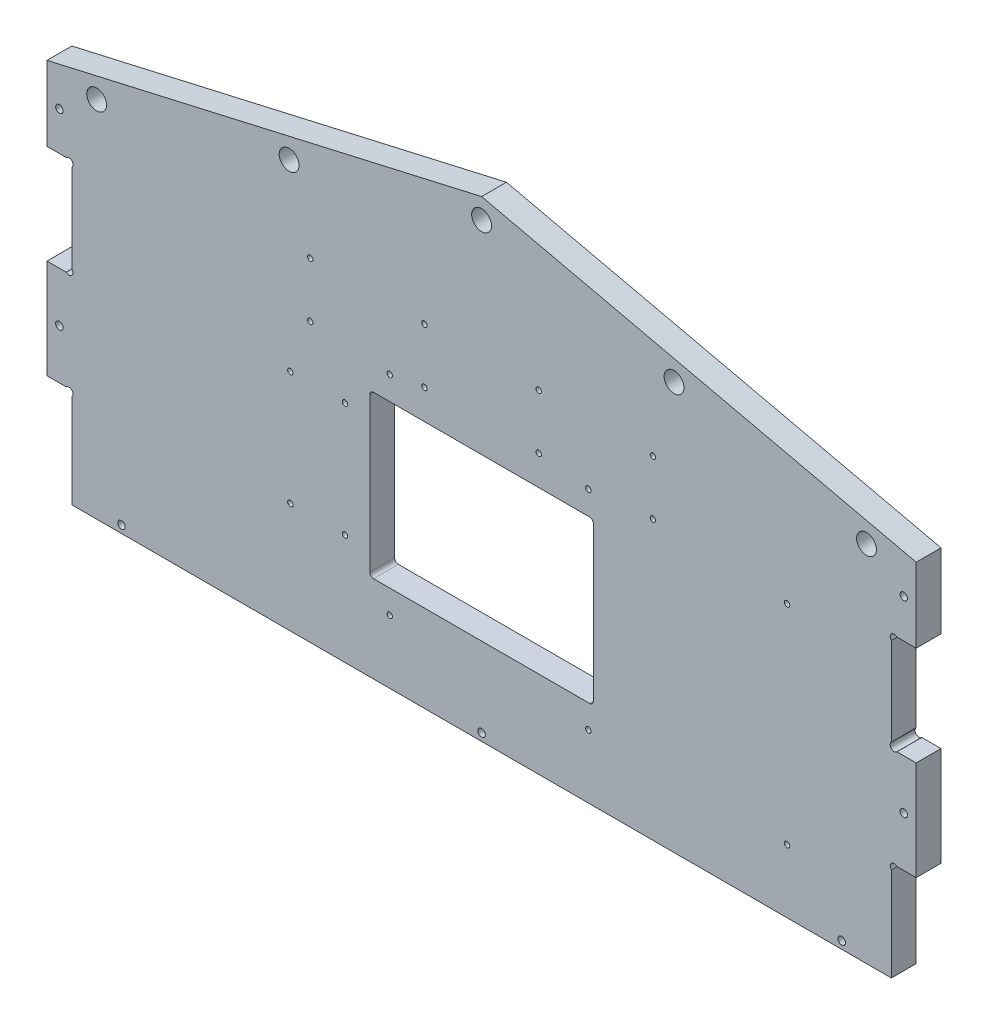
ISO-10303-21;
HEADER;
FILE_DESCRIPTION(('STEP AP214'),'2;1');
FILE_NAME('part.step','',(''),(''),'','','');
FILE_SCHEMA(('AUTOMOTIVE_DESIGN { 1 0 10303 214 1 1 1 1 }'));
ENDSEC;
DATA;
#1=APPLICATION_CONTEXT('core data for automotive mechanical design processes');
#2=APPLICATION_PROTOCOL_DEFINITION('international standard','automotive_design',2000,#1);
#3=PRODUCT_CONTEXT('',#1,'mechanical');
#4=PRODUCT('Part','Part','',(#3));
#5=PRODUCT_RELATED_PRODUCT_CATEGORY('part','',(#4));
#6=PRODUCT_DEFINITION_FORMATION('','',#4);
#7=PRODUCT_DEFINITION_CONTEXT('part definition',#1,'design');
#8=PRODUCT_DEFINITION('design','',#6,#7);
#9=PRODUCT_DEFINITION_SHAPE('','',#8);
#10=(LENGTH_UNIT() NAMED_UNIT(*) SI_UNIT(.MILLI.,.METRE.));
#11=(NAMED_UNIT(*) PLANE_ANGLE_UNIT() SI_UNIT($,.RADIAN.));
#12=(NAMED_UNIT(*) SI_UNIT($,.STERADIAN.) SOLID_ANGLE_UNIT());
#13=UNCERTAINTY_MEASURE_WITH_UNIT(LENGTH_MEASURE(1.E-05),#10,'distance_accuracy_value','');
#14=(GEOMETRIC_REPRESENTATION_CONTEXT(3) GLOBAL_UNCERTAINTY_ASSIGNED_CONTEXT((#13)) GLOBAL_UNIT_ASSIGNED_CONTEXT((#10,
#11,#12)) REPRESENTATION_CONTEXT('',''));
#15=CARTESIAN_POINT('',(0.,0.,0.));
#16=DIRECTION('',(0.,0.,1.));
#17=DIRECTION('',(1.,0.,0.));
#18=AXIS2_PLACEMENT_3D('',#15,#16,#17);
#19=CARTESIAN_POINT('',(0.,80.,10.));
#20=DIRECTION('',(1.,0.,0.));
#21=DIRECTION('',(0.,0.,-1.));
#22=AXIS2_PLACEMENT_3D('',#19,#20,#21);
#23=PLANE('',#22);
#24=DIRECTION('',(0.,-1.,0.));
#25=VECTOR('',#24,1.);
#26=CARTESIAN_POINT('',(0.,80.,0.));
#27=LINE('',#26,#25);
#28=CARTESIAN_POINT('',(0.,80.,0.));
#29=VERTEX_POINT('',#28);
#30=CARTESIAN_POINT('',(0.,40.,0.));
#31=VERTEX_POINT('',#30);
#32=EDGE_CURVE('E418',#29,#31,#27,.T.);
#33=ORIENTED_EDGE('',*,*,#32,.T.);
#34=DIRECTION('',(0.,0.,-1.));
#35=VECTOR('',#34,1.);
#36=CARTESIAN_POINT('',(0.,40.,10.));
#37=LINE('',#36,#35);
#38=CARTESIAN_POINT('',(0.,40.,10.));
#39=VERTEX_POINT('',#38);
#40=EDGE_CURVE('E528',#39,#31,#37,.T.);
#41=ORIENTED_EDGE('',*,*,#40,.F.);
#42=DIRECTION('',(0.,-1.,0.));
#43=VECTOR('',#42,1.);
#44=CARTESIAN_POINT('',(0.,80.,10.));
#45=LINE('',#44,#43);
#46=CARTESIAN_POINT('',(0.,80.,10.));
#47=VERTEX_POINT('',#46);
#48=EDGE_CURVE('E458',#47,#39,#45,.T.);
#49=ORIENTED_EDGE('',*,*,#48,.F.);
#50=DIRECTION('',(0.,0.,-1.));
#51=VECTOR('',#50,1.);
#52=CARTESIAN_POINT('',(0.,80.,10.));
#53=LINE('',#52,#51);
#54=EDGE_CURVE('E498',#47,#29,#53,.T.);
#55=ORIENTED_EDGE('',*,*,#54,.T.);
#56=EDGE_LOOP('',(#33,#41,#49,#55));
#57=FACE_BOUND('',#56,.T.);
#58=ADVANCED_FACE('F26',(#57),#23,.F.);
#59=CARTESIAN_POINT('',(0.,40.,10.));
#60=DIRECTION('',(0.,1.,0.));
#61=DIRECTION('',(0.,0.,1.));
#62=AXIS2_PLACEMENT_3D('',#59,#60,#61);
#63=PLANE('',#62);
#64=DIRECTION('',(1.,0.,0.));
#65=VECTOR('',#64,1.);
#66=CARTESIAN_POINT('',(0.,40.,0.));
#67=LINE('',#66,#65);
#68=CARTESIAN_POINT('',(7.73725830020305,40.,0.));
#69=VERTEX_POINT('',#68);
#70=EDGE_CURVE('E421',#31,#69,#67,.T.);
#71=ORIENTED_EDGE('',*,*,#70,.T.);
#72=DIRECTION('',(0.,0.,1.));
#73=VECTOR('',#72,1.);
#74=CARTESIAN_POINT('',(7.73725830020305,40.,0.));
#75=LINE('',#74,#73);
#76=CARTESIAN_POINT('',(7.73725830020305,40.,10.));
#77=VERTEX_POINT('',#76);
#78=EDGE_CURVE('E399',#69,#77,#75,.T.);
#79=ORIENTED_EDGE('',*,*,#78,.T.);
#80=DIRECTION('',(1.,0.,0.));
#81=VECTOR('',#80,1.);
#82=CARTESIAN_POINT('',(0.,40.,10.));
#83=LINE('',#82,#81);
#84=EDGE_CURVE('E461',#39,#77,#83,.T.);
#85=ORIENTED_EDGE('',*,*,#84,.F.);
#86=ORIENTED_EDGE('',*,*,#40,.T.);
#87=EDGE_LOOP('',(#71,#79,#85,#86));
#88=FACE_BOUND('',#87,.T.);
#89=ADVANCED_FACE('F583',(#88),#63,.F.);
#90=CARTESIAN_POINT('',(10.,40.,10.));
#91=DIRECTION('',(1.,0.,0.));
#92=DIRECTION('',(0.,0.,-1.));
#93=AXIS2_PLACEMENT_3D('',#90,#91,#92);
#94=PLANE('',#93);
#95=DIRECTION('',(0.,-1.,0.));
#96=VECTOR('',#95,1.);
#97=CARTESIAN_POINT('',(10.,40.,10.));
#98=LINE('',#97,#96);
#99=CARTESIAN_POINT('',(10.,37.7372583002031,10.));
#100=VERTEX_POINT('',#99);
#101=CARTESIAN_POINT('',(10.,0.,10.));
#102=VERTEX_POINT('',#101);
#103=EDGE_CURVE('E464',#100,#102,#98,.T.);
#104=ORIENTED_EDGE('',*,*,#103,.F.);
#105=DIRECTION('',(0.,0.,1.));
#106=VECTOR('',#105,1.);
#107=CARTESIAN_POINT('',(10.,37.7372583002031,0.));
#108=LINE('',#107,#106);
#109=CARTESIAN_POINT('',(10.,37.7372583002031,0.));
#110=VERTEX_POINT('',#109);
#111=EDGE_CURVE('E396',#100,#110,#108,.F.);
#112=ORIENTED_EDGE('',*,*,#111,.T.);
#113=DIRECTION('',(0.,-1.,0.));
#114=VECTOR('',#113,1.);
#115=CARTESIAN_POINT('',(10.,40.,0.));
#116=LINE('',#115,#114);
#117=CARTESIAN_POINT('',(10.,0.,0.));
#118=VERTEX_POINT('',#117);
#119=EDGE_CURVE('E424',#110,#118,#116,.T.);
#120=ORIENTED_EDGE('',*,*,#119,.T.);
#121=DIRECTION('',(0.,0.,-1.));
#122=VECTOR('',#121,1.);
#123=CARTESIAN_POINT('',(10.,0.,10.));
#124=LINE('',#123,#122);
#125=EDGE_CURVE('E525',#102,#118,#124,.T.);
#126=ORIENTED_EDGE('',*,*,#125,.F.);
#127=EDGE_LOOP('',(#104,#112,#120,#126));
#128=FACE_BOUND('',#127,.T.);
#129=ADVANCED_FACE('F578',(#128),#94,.F.);
#130=CARTESIAN_POINT('',(10.,0.,10.));
#131=DIRECTION('',(0.,1.,0.));
#132=DIRECTION('',(0.,0.,1.));
#133=AXIS2_PLACEMENT_3D('',#130,#131,#132);
#134=PLANE('',#133);
#135=DIRECTION('',(1.,0.,0.));
#136=VECTOR('',#135,1.);
#137=CARTESIAN_POINT('',(10.,0.,0.));
#138=LINE('',#137,#136);
#139=CARTESIAN_POINT('',(340.,0.,0.));
#140=VERTEX_POINT('',#139);
#141=EDGE_CURVE('E426',#118,#140,#138,.T.);
#142=ORIENTED_EDGE('',*,*,#141,.T.);
#143=DIRECTION('',(0.,0.,-1.));
#144=VECTOR('',#143,1.);
#145=CARTESIAN_POINT('',(340.,0.,10.));
#146=LINE('',#145,#144);
#147=CARTESIAN_POINT('',(340.,0.,10.));
#148=VERTEX_POINT('',#147);
#149=EDGE_CURVE('E522',#148,#140,#146,.T.);
#150=ORIENTED_EDGE('',*,*,#149,.F.);
#151=DIRECTION('',(1.,0.,0.));
#152=VECTOR('',#151,1.);
#153=CARTESIAN_POINT('',(10.,0.,10.));
#154=LINE('',#153,#152);
#155=EDGE_CURVE('E466',#102,#148,#154,.T.);
#156=ORIENTED_EDGE('',*,*,#155,.F.);
#157=ORIENTED_EDGE('',*,*,#125,.T.);
#158=EDGE_LOOP('',(#142,#150,#156,#157));
#159=FACE_BOUND('',#158,.T.);
#160=ADVANCED_FACE('F573',(#159),#134,.F.);
#161=CARTESIAN_POINT('',(340.,0.,10.));
#162=DIRECTION('',(-1.,0.,0.));
#163=DIRECTION('',(0.,0.,1.));
#164=AXIS2_PLACEMENT_3D('',#161,#162,#163);
#165=PLANE('',#164);
#166=DIRECTION('',(0.,1.,0.));
#167=VECTOR('',#166,1.);
#168=CARTESIAN_POINT('',(340.,0.,0.));
#169=LINE('',#168,#167);
#170=CARTESIAN_POINT('',(340.,37.7372583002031,0.));
#171=VERTEX_POINT('',#170);
#172=EDGE_CURVE('E428',#140,#171,#169,.T.);
#173=ORIENTED_EDGE('',*,*,#172,.T.);
#174=DIRECTION('',(0.,0.,1.));
#175=VECTOR('',#174,1.);
#176=CARTESIAN_POINT('',(340.,37.7372583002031,0.));
#177=LINE('',#176,#175);
#178=CARTESIAN_POINT('',(340.,37.7372583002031,10.));
#179=VERTEX_POINT('',#178);
#180=EDGE_CURVE('E374',#171,#179,#177,.T.);
#181=ORIENTED_EDGE('',*,*,#180,.T.);
#182=DIRECTION('',(0.,1.,0.));
#183=VECTOR('',#182,1.);
#184=CARTESIAN_POINT('',(340.,0.,10.));
#185=LINE('',#184,#183);
#186=EDGE_CURVE('E468',#148,#179,#185,.T.);
#187=ORIENTED_EDGE('',*,*,#186,.F.);
#188=ORIENTED_EDGE('',*,*,#149,.T.);
#189=EDGE_LOOP('',(#173,#181,#187,#188));
#190=FACE_BOUND('',#189,.T.);
#191=ADVANCED_FACE('F566',(#190),#165,.F.);
#192=CARTESIAN_POINT('',(340.,40.,10.));
#193=DIRECTION('',(0.,1.,0.));
#194=DIRECTION('',(0.,0.,1.));
#195=AXIS2_PLACEMENT_3D('',#192,#193,#194);
#196=PLANE('',#195);
#197=DIRECTION('',(1.,0.,0.));
#198=VECTOR('',#197,1.);
#199=CARTESIAN_POINT('',(340.,40.,10.));
#200=LINE('',#199,#198);
#201=CARTESIAN_POINT('',(342.262741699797,40.,10.));
#202=VERTEX_POINT('',#201);
#203=CARTESIAN_POINT('',(350.,40.,10.));
#204=VERTEX_POINT('',#203);
#205=EDGE_CURVE('E471',#202,#204,#200,.T.);
#206=ORIENTED_EDGE('',*,*,#205,.F.);
#207=DIRECTION('',(0.,0.,1.));
#208=VECTOR('',#207,1.);
#209=CARTESIAN_POINT('',(342.262741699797,40.,0.));
#210=LINE('',#209,#208);
#211=CARTESIAN_POINT('',(342.262741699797,40.,0.));
#212=VERTEX_POINT('',#211);
#213=EDGE_CURVE('E371',#202,#212,#210,.F.);
#214=ORIENTED_EDGE('',*,*,#213,.T.);
#215=DIRECTION('',(1.,0.,0.));
#216=VECTOR('',#215,1.);
#217=CARTESIAN_POINT('',(340.,40.,0.));
#218=LINE('',#217,#216);
#219=CARTESIAN_POINT('',(350.,40.,0.));
#220=VERTEX_POINT('',#219);
#221=EDGE_CURVE('E431',#212,#220,#218,.T.);
#222=ORIENTED_EDGE('',*,*,#221,.T.);
#223=DIRECTION('',(0.,0.,-1.));
#224=VECTOR('',#223,1.);
#225=CARTESIAN_POINT('',(350.,40.,10.));
#226=LINE('',#225,#224);
#227=EDGE_CURVE('E519',#204,#220,#226,.T.);
#228=ORIENTED_EDGE('',*,*,#227,.F.);
#229=EDGE_LOOP('',(#206,#214,#222,#228));
#230=FACE_BOUND('',#229,.T.);
#231=ADVANCED_FACE('F560',(#230),#196,.F.);
#232=CARTESIAN_POINT('',(350.,40.,10.));
#233=DIRECTION('',(-1.,0.,0.));
#234=DIRECTION('',(0.,0.,1.));
#235=AXIS2_PLACEMENT_3D('',#232,#233,#234);
#236=PLANE('',#235);
#237=DIRECTION('',(0.,1.,0.));
#238=VECTOR('',#237,1.);
#239=CARTESIAN_POINT('',(350.,40.,0.));
#240=LINE('',#239,#238);
#241=CARTESIAN_POINT('',(350.,80.,0.));
#242=VERTEX_POINT('',#241);
#243=EDGE_CURVE('E433',#220,#242,#240,.T.);
#244=ORIENTED_EDGE('',*,*,#243,.T.);
#245=DIRECTION('',(0.,0.,-1.));
#246=VECTOR('',#245,1.);
#247=CARTESIAN_POINT('',(350.,80.,10.));
#248=LINE('',#247,#246);
#249=CARTESIAN_POINT('',(350.,80.,10.));
#250=VERTEX_POINT('',#249);
#251=EDGE_CURVE('E516',#250,#242,#248,.T.);
#252=ORIENTED_EDGE('',*,*,#251,.F.);
#253=DIRECTION('',(0.,1.,0.));
#254=VECTOR('',#253,1.);
#255=CARTESIAN_POINT('',(350.,40.,10.));
#256=LINE('',#255,#254);
#257=EDGE_CURVE('E473',#204,#250,#256,.T.);
#258=ORIENTED_EDGE('',*,*,#257,.F.);
#259=ORIENTED_EDGE('',*,*,#227,.T.);
#260=EDGE_LOOP('',(#244,#252,#258,#259));
#261=FACE_BOUND('',#260,.T.);
#262=ADVANCED_FACE('F555',(#261),#236,.F.);
#263=CARTESIAN_POINT('',(350.,80.,10.));
#264=DIRECTION('',(0.,-1.,0.));
#265=DIRECTION('',(0.,0.,-1.));
#266=AXIS2_PLACEMENT_3D('',#263,#264,#265);
#267=PLANE('',#266);
#268=DIRECTION('',(-1.,0.,0.));
#269=VECTOR('',#268,1.);
#270=CARTESIAN_POINT('',(350.,80.,0.));
#271=LINE('',#270,#269);
#272=CARTESIAN_POINT('',(342.262741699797,80.,0.));
#273=VERTEX_POINT('',#272);
#274=EDGE_CURVE('E435',#242,#273,#271,.T.);
#275=ORIENTED_EDGE('',*,*,#274,.T.);
#276=DIRECTION('',(0.,0.,1.));
#277=VECTOR('',#276,1.);
#278=CARTESIAN_POINT('',(342.262741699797,80.,0.));
#279=LINE('',#278,#277);
#280=CARTESIAN_POINT('',(342.262741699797,80.,10.));
#281=VERTEX_POINT('',#280);
#282=EDGE_CURVE('E382',#273,#281,#279,.T.);
#283=ORIENTED_EDGE('',*,*,#282,.T.);
#284=DIRECTION('',(-1.,0.,0.));
#285=VECTOR('',#284,1.);
#286=CARTESIAN_POINT('',(350.,80.,10.));
#287=LINE('',#286,#285);
#288=EDGE_CURVE('E475',#250,#281,#287,.T.);
#289=ORIENTED_EDGE('',*,*,#288,.F.);
#290=ORIENTED_EDGE('',*,*,#251,.T.);
#291=EDGE_LOOP('',(#275,#283,#289,#290));
#292=FACE_BOUND('',#291,.T.);
#293=ADVANCED_FACE('F550',(#292),#267,.F.);
#294=CARTESIAN_POINT('',(340.,80.,10.));
#295=DIRECTION('',(-1.,0.,0.));
#296=DIRECTION('',(0.,0.,1.));
#297=AXIS2_PLACEMENT_3D('',#294,#295,#296);
#298=PLANE('',#297);
#299=DIRECTION('',(0.,1.,0.));
#300=VECTOR('',#299,1.);
#301=CARTESIAN_POINT('',(340.,80.,10.));
#302=LINE('',#301,#300);
#303=CARTESIAN_POINT('',(340.,82.262741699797,10.));
#304=VERTEX_POINT('',#303);
#305=CARTESIAN_POINT('',(340.,117.737258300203,10.));
#306=VERTEX_POINT('',#305);
#307=EDGE_CURVE('E478',#304,#306,#302,.T.);
#308=ORIENTED_EDGE('',*,*,#307,.F.);
#309=DIRECTION('',(0.,0.,1.));
#310=VECTOR('',#309,1.);
#311=CARTESIAN_POINT('',(340.,82.262741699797,0.));
#312=LINE('',#311,#310);
#313=CARTESIAN_POINT('',(340.,82.262741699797,0.));
#314=VERTEX_POINT('',#313);
#315=EDGE_CURVE('E379',#304,#314,#312,.F.);
#316=ORIENTED_EDGE('',*,*,#315,.T.);
#317=DIRECTION('',(0.,1.,0.));
#318=VECTOR('',#317,1.);
#319=CARTESIAN_POINT('',(340.,80.,0.));
#320=LINE('',#319,#318);
#321=CARTESIAN_POINT('',(340.,117.737258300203,0.));
#322=VERTEX_POINT('',#321);
#323=EDGE_CURVE('E438',#314,#322,#320,.T.);
#324=ORIENTED_EDGE('',*,*,#323,.T.);
#325=DIRECTION('',(0.,0.,1.));
#326=VECTOR('',#325,1.);
#327=CARTESIAN_POINT('',(340.,117.737258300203,0.));
#328=LINE('',#327,#326);
#329=EDGE_CURVE('E391',#322,#306,#328,.T.);
#330=ORIENTED_EDGE('',*,*,#329,.T.);
#331=EDGE_LOOP('',(#308,#316,#324,#330));
#332=FACE_BOUND('',#331,.T.);
#333=ADVANCED_FACE('F639',(#332),#298,.F.);
#334=CARTESIAN_POINT('',(340.,120.,10.));
#335=DIRECTION('',(0.,1.,0.));
#336=DIRECTION('',(-1.,0.,0.));
#337=AXIS2_PLACEMENT_3D('',#334,#335,#336);
#338=PLANE('',#337);
#339=DIRECTION('',(1.,0.,0.));
#340=VECTOR('',#339,1.);
#341=CARTESIAN_POINT('',(340.,120.,10.));
#342=LINE('',#341,#340);
#343=CARTESIAN_POINT('',(342.262741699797,120.,10.));
#344=VERTEX_POINT('',#343);
#345=CARTESIAN_POINT('',(350.,120.,10.));
#346=VERTEX_POINT('',#345);
#347=EDGE_CURVE('E480',#344,#346,#342,.T.);
#348=ORIENTED_EDGE('',*,*,#347,.F.);
#349=DIRECTION('',(0.,0.,1.));
#350=VECTOR('',#349,1.);
#351=CARTESIAN_POINT('',(342.262741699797,120.,0.));
#352=LINE('',#351,#350);
#353=CARTESIAN_POINT('',(342.262741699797,120.,0.));
#354=VERTEX_POINT('',#353);
#355=EDGE_CURVE('E388',#344,#354,#352,.F.);
#356=ORIENTED_EDGE('',*,*,#355,.T.);
#357=DIRECTION('',(1.,0.,0.));
#358=VECTOR('',#357,1.);
#359=CARTESIAN_POINT('',(340.,120.,0.));
#360=LINE('',#359,#358);
#361=CARTESIAN_POINT('',(350.,120.,0.));
#362=VERTEX_POINT('',#361);
#363=EDGE_CURVE('E440',#354,#362,#360,.T.);
#364=ORIENTED_EDGE('',*,*,#363,.T.);
#365=DIRECTION('',(0.,0.,-1.));
#366=VECTOR('',#365,1.);
#367=CARTESIAN_POINT('',(350.,120.,10.));
#368=LINE('',#367,#366);
#369=EDGE_CURVE('E513',#346,#362,#368,.T.);
#370=ORIENTED_EDGE('',*,*,#369,.F.);
#371=EDGE_LOOP('',(#348,#356,#364,#370));
#372=FACE_BOUND('',#371,.T.);
#373=ADVANCED_FACE('F632',(#372),#338,.F.);
#374=CARTESIAN_POINT('',(350.,120.,10.));
#375=DIRECTION('',(-1.,0.,0.));
#376=DIRECTION('',(0.,0.,1.));
#377=AXIS2_PLACEMENT_3D('',#374,#375,#376);
#378=PLANE('',#377);
#379=DIRECTION('',(0.,1.,0.));
#380=VECTOR('',#379,1.);
#381=CARTESIAN_POINT('',(350.,120.,0.));
#382=LINE('',#381,#380);
#383=CARTESIAN_POINT('',(350.,150.,0.));
#384=VERTEX_POINT('',#383);
#385=EDGE_CURVE('E442',#362,#384,#382,.T.);
#386=ORIENTED_EDGE('',*,*,#385,.T.);
#387=DIRECTION('',(0.,0.,-1.));
#388=VECTOR('',#387,1.);
#389=CARTESIAN_POINT('',(350.,150.,10.));
#390=LINE('',#389,#388);
#391=CARTESIAN_POINT('',(350.,150.,10.));
#392=VERTEX_POINT('',#391);
#393=EDGE_CURVE('E510',#392,#384,#390,.T.);
#394=ORIENTED_EDGE('',*,*,#393,.F.);
#395=DIRECTION('',(0.,1.,0.));
#396=VECTOR('',#395,1.);
#397=CARTESIAN_POINT('',(350.,120.,10.));
#398=LINE('',#397,#396);
#399=EDGE_CURVE('E482',#346,#392,#398,.T.);
#400=ORIENTED_EDGE('',*,*,#399,.F.);
#401=ORIENTED_EDGE('',*,*,#369,.T.);
#402=EDGE_LOOP('',(#386,#394,#400,#401));
#403=FACE_BOUND('',#402,.T.);
#404=ADVANCED_FACE('F628',(#403),#378,.F.);
#405=CARTESIAN_POINT('',(350.,150.,10.));
#406=DIRECTION('',(-0.222824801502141,-0.974858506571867,0.));
#407=DIRECTION('',(0.974858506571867,-0.222824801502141,0.));
#408=AXIS2_PLACEMENT_3D('',#405,#406,#407);
#409=PLANE('',#408);
#410=DIRECTION('',(-0.974858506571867,0.222824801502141,0.));
#411=VECTOR('',#410,1.);
#412=CARTESIAN_POINT('',(350.,150.,0.));
#413=LINE('',#412,#411);
#414=CARTESIAN_POINT('',(175.,190.,0.));
#415=VERTEX_POINT('',#414);
#416=EDGE_CURVE('E444',#384,#415,#413,.T.);
#417=ORIENTED_EDGE('',*,*,#416,.T.);
#418=DIRECTION('',(0.,0.,-1.));
#419=VECTOR('',#418,1.);
#420=CARTESIAN_POINT('',(175.,190.,10.));
#421=LINE('',#420,#419);
#422=CARTESIAN_POINT('',(175.,190.,10.));
#423=VERTEX_POINT('',#422);
#424=EDGE_CURVE('E507',#423,#415,#421,.T.);
#425=ORIENTED_EDGE('',*,*,#424,.F.);
#426=DIRECTION('',(-0.974858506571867,0.222824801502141,0.));
#427=VECTOR('',#426,1.);
#428=CARTESIAN_POINT('',(350.,150.,10.));
#429=LINE('',#428,#427);
#430=EDGE_CURVE('E484',#392,#423,#429,.T.);
#431=ORIENTED_EDGE('',*,*,#430,.F.);
#432=ORIENTED_EDGE('',*,*,#393,.T.);
#433=EDGE_LOOP('',(#417,#425,#431,#432));
#434=FACE_BOUND('',#433,.T.);
#435=ADVANCED_FACE('F623',(#434),#409,.F.);
#436=CARTESIAN_POINT('',(175.,190.,10.));
#437=DIRECTION('',(0.222824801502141,-0.974858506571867,0.));
#438=DIRECTION('',(0.974858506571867,0.222824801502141,0.));
#439=AXIS2_PLACEMENT_3D('',#436,#437,#438);
#440=PLANE('',#439);
#441=DIRECTION('',(-0.974858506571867,-0.222824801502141,0.));
#442=VECTOR('',#441,1.);
#443=CARTESIAN_POINT('',(175.,190.,0.));
#444=LINE('',#443,#442);
#445=CARTESIAN_POINT('',(0.,150.,0.));
#446=VERTEX_POINT('',#445);
#447=EDGE_CURVE('E446',#415,#446,#444,.T.);
#448=ORIENTED_EDGE('',*,*,#447,.T.);
#449=DIRECTION('',(0.,0.,-1.));
#450=VECTOR('',#449,1.);
#451=CARTESIAN_POINT('',(0.,150.,10.));
#452=LINE('',#451,#450);
#453=CARTESIAN_POINT('',(0.,150.,10.));
#454=VERTEX_POINT('',#453);
#455=EDGE_CURVE('E504',#454,#446,#452,.T.);
#456=ORIENTED_EDGE('',*,*,#455,.F.);
#457=DIRECTION('',(-0.974858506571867,-0.222824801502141,0.));
#458=VECTOR('',#457,1.);
#459=CARTESIAN_POINT('',(175.,190.,10.));
#460=LINE('',#459,#458);
#461=EDGE_CURVE('E486',#423,#454,#460,.T.);
#462=ORIENTED_EDGE('',*,*,#461,.F.);
#463=ORIENTED_EDGE('',*,*,#424,.T.);
#464=EDGE_LOOP('',(#448,#456,#462,#463));
#465=FACE_BOUND('',#464,.T.);
#466=ADVANCED_FACE('F617',(#465),#440,.F.);
#467=CARTESIAN_POINT('',(0.,150.,10.));
#468=DIRECTION('',(1.,0.,0.));
#469=DIRECTION('',(0.,0.,-1.));
#470=AXIS2_PLACEMENT_3D('',#467,#468,#469);
#471=PLANE('',#470);
#472=DIRECTION('',(0.,-1.,0.));
#473=VECTOR('',#472,1.);
#474=CARTESIAN_POINT('',(0.,150.,0.));
#475=LINE('',#474,#473);
#476=CARTESIAN_POINT('',(0.,120.,0.));
#477=VERTEX_POINT('',#476);
#478=EDGE_CURVE('E448',#446,#477,#475,.T.);
#479=ORIENTED_EDGE('',*,*,#478,.T.);
#480=DIRECTION('',(0.,0.,-1.));
#481=VECTOR('',#480,1.);
#482=CARTESIAN_POINT('',(0.,120.,10.));
#483=LINE('',#482,#481);
#484=CARTESIAN_POINT('',(0.,120.,10.));
#485=VERTEX_POINT('',#484);
#486=EDGE_CURVE('E501',#485,#477,#483,.T.);
#487=ORIENTED_EDGE('',*,*,#486,.F.);
#488=DIRECTION('',(0.,-1.,0.));
#489=VECTOR('',#488,1.);
#490=CARTESIAN_POINT('',(0.,150.,10.));
#491=LINE('',#490,#489);
#492=EDGE_CURVE('E488',#454,#485,#491,.T.);
#493=ORIENTED_EDGE('',*,*,#492,.F.);
#494=ORIENTED_EDGE('',*,*,#455,.T.);
#495=EDGE_LOOP('',(#479,#487,#493,#494));
#496=FACE_BOUND('',#495,.T.);
#497=ADVANCED_FACE('F613',(#496),#471,.F.);
#498=CARTESIAN_POINT('',(0.,120.,10.));
#499=DIRECTION('',(0.,1.,0.));
#500=DIRECTION('',(-1.,0.,0.));
#501=AXIS2_PLACEMENT_3D('',#498,#499,#500);
#502=PLANE('',#501);
#503=DIRECTION('',(1.,0.,0.));
#504=VECTOR('',#503,1.);
#505=CARTESIAN_POINT('',(0.,120.,0.));
#506=LINE('',#505,#504);
#507=CARTESIAN_POINT('',(7.73725830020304,120.,0.));
#508=VERTEX_POINT('',#507);
#509=EDGE_CURVE('E450',#477,#508,#506,.T.);
#510=ORIENTED_EDGE('',*,*,#509,.T.);
#511=DIRECTION('',(0.,0.,1.));
#512=VECTOR('',#511,1.);
#513=CARTESIAN_POINT('',(7.73725830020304,120.,0.));
#514=LINE('',#513,#512);
#515=CARTESIAN_POINT('',(7.73725830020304,120.,10.));
#516=VERTEX_POINT('',#515);
#517=EDGE_CURVE('E415',#508,#516,#514,.T.);
#518=ORIENTED_EDGE('',*,*,#517,.T.);
#519=DIRECTION('',(1.,0.,0.));
#520=VECTOR('',#519,1.);
#521=CARTESIAN_POINT('',(0.,120.,10.));
#522=LINE('',#521,#520);
#523=EDGE_CURVE('E490',#485,#516,#522,.T.);
#524=ORIENTED_EDGE('',*,*,#523,.F.);
#525=ORIENTED_EDGE('',*,*,#486,.T.);
#526=EDGE_LOOP('',(#510,#518,#524,#525));
#527=FACE_BOUND('',#526,.T.);
#528=ADVANCED_FACE('F608',(#527),#502,.F.);
#529=CARTESIAN_POINT('',(10.,120.,10.));
#530=DIRECTION('',(1.,0.,0.));
#531=DIRECTION('',(0.,0.,-1.));
#532=AXIS2_PLACEMENT_3D('',#529,#530,#531);
#533=PLANE('',#532);
#534=DIRECTION('',(0.,-1.,0.));
#535=VECTOR('',#534,1.);
#536=CARTESIAN_POINT('',(10.,120.,0.));
#537=LINE('',#536,#535);
#538=CARTESIAN_POINT('',(10.,117.737258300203,0.));
#539=VERTEX_POINT('',#538);
#540=CARTESIAN_POINT('',(10.,82.262741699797,0.));
#541=VERTEX_POINT('',#540);
#542=EDGE_CURVE('E453',#539,#541,#537,.T.);
#543=ORIENTED_EDGE('',*,*,#542,.T.);
#544=DIRECTION('',(0.,0.,1.));
#545=VECTOR('',#544,1.);
#546=CARTESIAN_POINT('',(10.,82.262741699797,0.));
#547=LINE('',#546,#545);
#548=CARTESIAN_POINT('',(9.99999999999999,82.262741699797,10.));
#549=VERTEX_POINT('',#548);
#550=EDGE_CURVE('E407',#541,#549,#547,.T.);
#551=ORIENTED_EDGE('',*,*,#550,.T.);
#552=DIRECTION('',(0.,-1.,0.));
#553=VECTOR('',#552,1.);
#554=CARTESIAN_POINT('',(10.,120.,10.));
#555=LINE('',#554,#553);
#556=CARTESIAN_POINT('',(10.,117.737258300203,10.));
#557=VERTEX_POINT('',#556);
#558=EDGE_CURVE('E493',#557,#549,#555,.T.);
#559=ORIENTED_EDGE('',*,*,#558,.F.);
#560=DIRECTION('',(0.,0.,1.));
#561=VECTOR('',#560,1.);
#562=CARTESIAN_POINT('',(10.,117.737258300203,0.));
#563=LINE('',#562,#561);
#564=EDGE_CURVE('E412',#557,#539,#563,.F.);
#565=ORIENTED_EDGE('',*,*,#564,.T.);
#566=EDGE_LOOP('',(#543,#551,#559,#565));
#567=FACE_BOUND('',#566,.T.);
#568=ADVANCED_FACE('F598',(#567),#533,.F.);
#569=CARTESIAN_POINT('',(10.,80.,10.));
#570=DIRECTION('',(0.,-1.,0.));
#571=DIRECTION('',(0.,0.,-1.));
#572=AXIS2_PLACEMENT_3D('',#569,#570,#571);
#573=PLANE('',#572);
#574=DIRECTION('',(-1.,0.,0.));
#575=VECTOR('',#574,1.);
#576=CARTESIAN_POINT('',(10.,80.,10.));
#577=LINE('',#576,#575);
#578=CARTESIAN_POINT('',(7.73725830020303,80.,10.));
#579=VERTEX_POINT('',#578);
#580=EDGE_CURVE('E496',#579,#47,#577,.T.);
#581=ORIENTED_EDGE('',*,*,#580,.F.);
#582=DIRECTION('',(0.,0.,1.));
#583=VECTOR('',#582,1.);
#584=CARTESIAN_POINT('',(7.73725830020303,80.,0.));
#585=LINE('',#584,#583);
#586=CARTESIAN_POINT('',(7.73725830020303,80.,0.));
#587=VERTEX_POINT('',#586);
#588=EDGE_CURVE('E404',#579,#587,#585,.F.);
#589=ORIENTED_EDGE('',*,*,#588,.T.);
#590=DIRECTION('',(-1.,0.,0.));
#591=VECTOR('',#590,1.);
#592=CARTESIAN_POINT('',(10.,80.,0.));
#593=LINE('',#592,#591);
#594=EDGE_CURVE('E456',#587,#29,#593,.T.);
#595=ORIENTED_EDGE('',*,*,#594,.T.);
#596=ORIENTED_EDGE('',*,*,#54,.F.);
#597=EDGE_LOOP('',(#581,#589,#595,#596));
#598=FACE_BOUND('',#597,.T.);
#599=ADVANCED_FACE('F592',(#598),#573,.F.);
#600=CARTESIAN_POINT('',(0.,40.,10.));
#601=DIRECTION('',(0.,0.,1.));
#602=DIRECTION('',(1.,0.,0.));
#603=AXIS2_PLACEMENT_3D('',#600,#601,#602);
#604=PLANE('',#603);
#605=CARTESIAN_POINT('',(120.,44.5,10.));
#606=DIRECTION('',(0.,0.,-1.));
#607=DIRECTION('',(-1.,0.,0.));
#608=AXIS2_PLACEMENT_3D('',#605,#606,#607);
#609=CIRCLE('',#608,1.10000000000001);
#610=CARTESIAN_POINT('',(118.9,44.5,10.));
#611=VERTEX_POINT('',#610);
#612=EDGE_CURVE('E1015',#611,#611,#609,.T.);
#613=ORIENTED_EDGE('',*,*,#612,.T.);
#614=EDGE_LOOP('',(#613));
#615=FACE_BOUND('',#614,.T.);
#616=CARTESIAN_POINT('',(98.,44.5,10.));
#617=DIRECTION('',(0.,0.,-1.));
#618=DIRECTION('',(-1.,0.,0.));
#619=AXIS2_PLACEMENT_3D('',#616,#617,#618);
#620=CIRCLE('',#619,1.10000000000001);
#621=CARTESIAN_POINT('',(96.9,44.5,10.));
#622=VERTEX_POINT('',#621);
#623=EDGE_CURVE('E1025',#622,#622,#620,.T.);
#624=ORIENTED_EDGE('',*,*,#623,.T.);
#625=EDGE_LOOP('',(#624));
#626=FACE_BOUND('',#625,.T.);
#627=CARTESIAN_POINT('',(98.,90.5,10.));
#628=DIRECTION('',(0.,0.,-1.));
#629=DIRECTION('',(-1.,0.,0.));
#630=AXIS2_PLACEMENT_3D('',#627,#628,#629);
#631=CIRCLE('',#630,1.10000000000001);
#632=CARTESIAN_POINT('',(96.9,90.5,10.));
#633=VERTEX_POINT('',#632);
#634=EDGE_CURVE('E1031',#633,#633,#631,.T.);
#635=ORIENTED_EDGE('',*,*,#634,.T.);
#636=EDGE_LOOP('',(#635));
#637=FACE_BOUND('',#636,.T.);
#638=CARTESIAN_POINT('',(120.,90.5,10.));
#639=DIRECTION('',(0.,0.,-1.));
#640=DIRECTION('',(-1.,0.,0.));
#641=AXIS2_PLACEMENT_3D('',#638,#639,#640);
#642=CIRCLE('',#641,1.10000000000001);
#643=CARTESIAN_POINT('',(118.9,90.5,10.));
#644=VERTEX_POINT('',#643);
#645=EDGE_CURVE('E1037',#644,#644,#642,.T.);
#646=ORIENTED_EDGE('',*,*,#645,.T.);
#647=EDGE_LOOP('',(#646));
#648=FACE_BOUND('',#647,.T.);
#649=CARTESIAN_POINT('',(138.,25.5,10.));
#650=DIRECTION('',(0.,0.,1.));
#651=DIRECTION('',(1.,0.,0.));
#652=AXIS2_PLACEMENT_3D('',#649,#650,#651);
#653=CIRCLE('',#652,1.09999999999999);
#654=CARTESIAN_POINT('',(139.1,25.5,10.));
#655=VERTEX_POINT('',#654);
#656=EDGE_CURVE('E1040',#655,#655,#653,.T.);
#657=ORIENTED_EDGE('',*,*,#656,.F.);
#658=EDGE_LOOP('',(#657));
#659=FACE_BOUND('',#658,.T.);
#660=CARTESIAN_POINT('',(218.,25.5,10.));
#661=DIRECTION('',(0.,0.,1.));
#662=DIRECTION('',(1.,0.,0.));
#663=AXIS2_PLACEMENT_3D('',#660,#661,#662);
#664=CIRCLE('',#663,1.09999999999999);
#665=CARTESIAN_POINT('',(219.1,25.5,10.));
#666=VERTEX_POINT('',#665);
#667=EDGE_CURVE('E1046',#666,#666,#664,.T.);
#668=ORIENTED_EDGE('',*,*,#667,.F.);
#669=EDGE_LOOP('',(#668));
#670=FACE_BOUND('',#669,.T.);
#671=CARTESIAN_POINT('',(298.,25.5,10.));
#672=DIRECTION('',(0.,0.,1.));
#673=DIRECTION('',(1.,0.,0.));
#674=AXIS2_PLACEMENT_3D('',#671,#672,#673);
#675=CIRCLE('',#674,1.09999999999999);
#676=CARTESIAN_POINT('',(299.1,25.5,10.));
#677=VERTEX_POINT('',#676);
#678=EDGE_CURVE('E1052',#677,#677,#675,.T.);
#679=ORIENTED_EDGE('',*,*,#678,.F.);
#680=EDGE_LOOP('',(#679));
#681=FACE_BOUND('',#680,.T.);
#682=CARTESIAN_POINT('',(298.,109.5,10.));
#683=DIRECTION('',(0.,0.,1.));
#684=DIRECTION('',(1.,0.,0.));
#685=AXIS2_PLACEMENT_3D('',#682,#683,#684);
#686=CIRCLE('',#685,1.09999999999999);
#687=CARTESIAN_POINT('',(299.1,109.5,10.));
#688=VERTEX_POINT('',#687);
#689=EDGE_CURVE('E1058',#688,#688,#686,.T.);
#690=ORIENTED_EDGE('',*,*,#689,.F.);
#691=EDGE_LOOP('',(#690));
#692=FACE_BOUND('',#691,.T.);
#693=CARTESIAN_POINT('',(218.,109.5,10.));
#694=DIRECTION('',(0.,0.,1.));
#695=DIRECTION('',(1.,0.,0.));
#696=AXIS2_PLACEMENT_3D('',#693,#694,#695);
#697=CIRCLE('',#696,1.09999999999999);
#698=CARTESIAN_POINT('',(219.1,109.5,10.));
#699=VERTEX_POINT('',#698);
#700=EDGE_CURVE('E1064',#699,#699,#697,.T.);
#701=ORIENTED_EDGE('',*,*,#700,.F.);
#702=EDGE_LOOP('',(#701));
#703=FACE_BOUND('',#702,.T.);
#704=CARTESIAN_POINT('',(138.,109.5,10.));
#705=DIRECTION('',(0.,0.,1.));
#706=DIRECTION('',(1.,0.,0.));
#707=AXIS2_PLACEMENT_3D('',#704,#705,#706);
#708=CIRCLE('',#707,1.09999999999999);
#709=CARTESIAN_POINT('',(139.1,109.5,10.));
#710=VERTEX_POINT('',#709);
#711=EDGE_CURVE('E1070',#710,#710,#708,.T.);
#712=ORIENTED_EDGE('',*,*,#711,.F.);
#713=EDGE_LOOP('',(#712));
#714=FACE_BOUND('',#713,.T.);
#715=CARTESIAN_POINT('',(244.,112.,10.));
#716=DIRECTION('',(0.,0.,1.));
#717=DIRECTION('',(1.,0.,0.));
#718=AXIS2_PLACEMENT_3D('',#715,#716,#717);
#719=CIRCLE('',#718,1.09999999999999);
#720=CARTESIAN_POINT('',(245.1,112.,10.));
#721=VERTEX_POINT('',#720);
#722=EDGE_CURVE('E1076',#721,#721,#719,.T.);
#723=ORIENTED_EDGE('',*,*,#722,.F.);
#724=EDGE_LOOP('',(#723));
#725=FACE_BOUND('',#724,.T.);
#726=CARTESIAN_POINT('',(244.,134.,10.));
#727=DIRECTION('',(0.,0.,1.));
#728=DIRECTION('',(1.,0.,0.));
#729=AXIS2_PLACEMENT_3D('',#726,#727,#728);
#730=CIRCLE('',#729,1.09999999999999);
#731=CARTESIAN_POINT('',(245.1,134.,10.));
#732=VERTEX_POINT('',#731);
#733=EDGE_CURVE('E1082',#732,#732,#730,.T.);
#734=ORIENTED_EDGE('',*,*,#733,.F.);
#735=EDGE_LOOP('',(#734));
#736=FACE_BOUND('',#735,.T.);
#737=CARTESIAN_POINT('',(106.,112.,10.));
#738=DIRECTION('',(0.,0.,1.));
#739=DIRECTION('',(1.,0.,0.));
#740=AXIS2_PLACEMENT_3D('',#737,#738,#739);
#741=CIRCLE('',#740,1.10000000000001);
#742=CARTESIAN_POINT('',(107.1,112.,10.));
#743=VERTEX_POINT('',#742);
#744=EDGE_CURVE('E1088',#743,#743,#741,.T.);
#745=ORIENTED_EDGE('',*,*,#744,.F.);
#746=EDGE_LOOP('',(#745));
#747=FACE_BOUND('',#746,.T.);
#748=CARTESIAN_POINT('',(106.,134.,10.));
#749=DIRECTION('',(0.,0.,1.));
#750=DIRECTION('',(1.,0.,0.));
#751=AXIS2_PLACEMENT_3D('',#748,#749,#750);
#752=CIRCLE('',#751,1.1);
#753=CARTESIAN_POINT('',(107.1,134.,10.));
#754=VERTEX_POINT('',#753);
#755=EDGE_CURVE('E1094',#754,#754,#752,.T.);
#756=ORIENTED_EDGE('',*,*,#755,.F.);
#757=EDGE_LOOP('',(#756));
#758=FACE_BOUND('',#757,.T.);
#759=CARTESIAN_POINT('',(152.,134.,10.));
#760=DIRECTION('',(0.,0.,1.));
#761=DIRECTION('',(1.,0.,0.));
#762=AXIS2_PLACEMENT_3D('',#759,#760,#761);
#763=CIRCLE('',#762,1.09999999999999);
#764=CARTESIAN_POINT('',(153.1,134.,10.));
#765=VERTEX_POINT('',#764);
#766=EDGE_CURVE('E1100',#765,#765,#763,.T.);
#767=ORIENTED_EDGE('',*,*,#766,.F.);
#768=EDGE_LOOP('',(#767));
#769=FACE_BOUND('',#768,.T.);
#770=CARTESIAN_POINT('',(152.,112.,10.));
#771=DIRECTION('',(0.,0.,1.));
#772=DIRECTION('',(1.,0.,0.));
#773=AXIS2_PLACEMENT_3D('',#770,#771,#772);
#774=CIRCLE('',#773,1.09999999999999);
#775=CARTESIAN_POINT('',(153.1,112.,10.));
#776=VERTEX_POINT('',#775);
#777=EDGE_CURVE('E1106',#776,#776,#774,.T.);
#778=ORIENTED_EDGE('',*,*,#777,.F.);
#779=EDGE_LOOP('',(#778));
#780=FACE_BOUND('',#779,.T.);
#781=CARTESIAN_POINT('',(198.,112.,10.));
#782=DIRECTION('',(0.,0.,1.));
#783=DIRECTION('',(1.,0.,0.));
#784=AXIS2_PLACEMENT_3D('',#781,#782,#783);
#785=CIRCLE('',#784,1.09999999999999);
#786=CARTESIAN_POINT('',(199.1,112.,10.));
#787=VERTEX_POINT('',#786);
#788=EDGE_CURVE('E1112',#787,#787,#785,.T.);
#789=ORIENTED_EDGE('',*,*,#788,.F.);
#790=EDGE_LOOP('',(#789));
#791=FACE_BOUND('',#790,.T.);
#792=CARTESIAN_POINT('',(198.,134.,10.));
#793=DIRECTION('',(0.,0.,1.));
#794=DIRECTION('',(1.,0.,0.));
#795=AXIS2_PLACEMENT_3D('',#792,#793,#794);
#796=CIRCLE('',#795,1.09999999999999);
#797=CARTESIAN_POINT('',(199.1,134.,10.));
#798=VERTEX_POINT('',#797);
#799=EDGE_CURVE('E1118',#798,#798,#796,.T.);
#800=ORIENTED_EDGE('',*,*,#799,.F.);
#801=EDGE_LOOP('',(#800));
#802=FACE_BOUND('',#801,.T.);
#803=CARTESIAN_POINT('',(131.5,98.5,10.));
#804=DIRECTION('',(0.,0.,1.));
#805=DIRECTION('',(1.,0.,0.));
#806=AXIS2_PLACEMENT_3D('',#803,#804,#805);
#807=CIRCLE('',#806,1.5);
#808=CARTESIAN_POINT('',(131.5,100.,10.));
#809=VERTEX_POINT('',#808);
#810=CARTESIAN_POINT('',(130.,98.5,10.));
#811=VERTEX_POINT('',#810);
#812=EDGE_CURVE('E40',#809,#811,#807,.T.);
#813=ORIENTED_EDGE('',*,*,#812,.F.);
#814=DIRECTION('',(-1.,0.,0.));
#815=VECTOR('',#814,1.);
#816=CARTESIAN_POINT('',(131.5,100.,10.));
#817=LINE('',#816,#815);
#818=CARTESIAN_POINT('',(218.5,100.,10.));
#819=VERTEX_POINT('',#818);
#820=EDGE_CURVE('E261',#819,#809,#817,.T.);
#821=ORIENTED_EDGE('',*,*,#820,.F.);
#822=CARTESIAN_POINT('',(218.5,98.5,10.));
#823=DIRECTION('',(0.,0.,1.));
#824=DIRECTION('',(1.,0.,0.));
#825=AXIS2_PLACEMENT_3D('',#822,#823,#824);
#826=CIRCLE('',#825,1.5);
#827=CARTESIAN_POINT('',(220.,98.5,10.));
#828=VERTEX_POINT('',#827);
#829=EDGE_CURVE('E258',#828,#819,#826,.T.);
#830=ORIENTED_EDGE('',*,*,#829,.F.);
#831=DIRECTION('',(0.,1.,0.));
#832=VECTOR('',#831,1.);
#833=CARTESIAN_POINT('',(220.,98.5,10.));
#834=LINE('',#833,#832);
#835=CARTESIAN_POINT('',(220.,36.5,10.));
#836=VERTEX_POINT('',#835);
#837=EDGE_CURVE('E255',#836,#828,#834,.T.);
#838=ORIENTED_EDGE('',*,*,#837,.F.);
#839=CARTESIAN_POINT('',(218.5,36.5,10.));
#840=DIRECTION('',(0.,0.,1.));
#841=DIRECTION('',(1.,0.,0.));
#842=AXIS2_PLACEMENT_3D('',#839,#840,#841);
#843=CIRCLE('',#842,1.5);
#844=CARTESIAN_POINT('',(218.5,35.,10.));
#845=VERTEX_POINT('',#844);
#846=EDGE_CURVE('E249',#845,#836,#843,.T.);
#847=ORIENTED_EDGE('',*,*,#846,.F.);
#848=DIRECTION('',(1.,0.,0.));
#849=VECTOR('',#848,1.);
#850=CARTESIAN_POINT('',(131.5,35.,10.));
#851=LINE('',#850,#849);
#852=CARTESIAN_POINT('',(131.5,35.,10.));
#853=VERTEX_POINT('',#852);
#854=EDGE_CURVE('E247',#853,#845,#851,.T.);
#855=ORIENTED_EDGE('',*,*,#854,.F.);
#856=CARTESIAN_POINT('',(131.5,36.5,10.));
#857=DIRECTION('',(0.,0.,1.));
#858=DIRECTION('',(1.,0.,0.));
#859=AXIS2_PLACEMENT_3D('',#856,#857,#858);
#860=CIRCLE('',#859,1.5);
#861=CARTESIAN_POINT('',(130.,36.5,10.));
#862=VERTEX_POINT('',#861);
#863=EDGE_CURVE('E230',#862,#853,#860,.T.);
#864=ORIENTED_EDGE('',*,*,#863,.F.);
#865=DIRECTION('',(0.,-1.,0.));
#866=VECTOR('',#865,1.);
#867=CARTESIAN_POINT('',(130.,98.5,10.));
#868=LINE('',#867,#866);
#869=EDGE_CURVE('E239',#811,#862,#868,.T.);
#870=ORIENTED_EDGE('',*,*,#869,.F.);
#871=EDGE_LOOP('',(#813,#821,#830,#838,#847,#855,#864,#870));
#872=FACE_BOUND('',#871,.T.);
#873=CARTESIAN_POINT('',(97.498748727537,164.079109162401,10.));
#874=DIRECTION('',(0.,0.,1.));
#875=DIRECTION('',(1.,0.,0.));
#876=AXIS2_PLACEMENT_3D('',#873,#874,#875);
#877=CIRCLE('',#876,4.00000000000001);
#878=CARTESIAN_POINT('',(101.498748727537,164.079109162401,10.));
#879=VERTEX_POINT('',#878);
#880=EDGE_CURVE('E287',#879,#879,#877,.T.);
#881=ORIENTED_EDGE('',*,*,#880,.F.);
#882=EDGE_LOOP('',(#881));
#883=FACE_BOUND('',#882,.T.);
#884=CARTESIAN_POINT('',(252.501251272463,164.079109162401,10.));
#885=DIRECTION('',(0.,0.,1.));
#886=DIRECTION('',(1.,0.,0.));
#887=AXIS2_PLACEMENT_3D('',#884,#885,#886);
#888=CIRCLE('',#887,3.99999999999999);
#889=CARTESIAN_POINT('',(256.501251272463,164.079109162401,10.));
#890=VERTEX_POINT('',#889);
#891=EDGE_CURVE('E303',#890,#890,#888,.T.);
#892=ORIENTED_EDGE('',*,*,#891,.F.);
#893=EDGE_LOOP('',(#892));
#894=FACE_BOUND('',#893,.T.);
#895=CARTESIAN_POINT('',(20.,146.36510945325,10.));
#896=DIRECTION('',(0.,0.,1.));
#897=DIRECTION('',(1.,0.,0.));
#898=AXIS2_PLACEMENT_3D('',#895,#896,#897);
#899=CIRCLE('',#898,4.00000000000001);
#900=CARTESIAN_POINT('',(24.,146.36510945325,10.));
#901=VERTEX_POINT('',#900);
#902=EDGE_CURVE('E309',#901,#901,#899,.T.);
#903=ORIENTED_EDGE('',*,*,#902,.F.);
#904=EDGE_LOOP('',(#903));
#905=FACE_BOUND('',#904,.T.);
#906=CARTESIAN_POINT('',(330.,146.36510945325,10.));
#907=DIRECTION('',(0.,0.,1.));
#908=DIRECTION('',(1.,0.,0.));
#909=AXIS2_PLACEMENT_3D('',#906,#907,#908);
#910=CIRCLE('',#909,3.99999999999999);
#911=CARTESIAN_POINT('',(334.,146.36510945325,10.));
#912=VERTEX_POINT('',#911);
#913=EDGE_CURVE('E315',#912,#912,#910,.T.);
#914=ORIENTED_EDGE('',*,*,#913,.F.);
#915=EDGE_LOOP('',(#914));
#916=FACE_BOUND('',#915,.T.);
#917=CARTESIAN_POINT('',(175.,181.793680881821,10.));
#918=DIRECTION('',(0.,0.,1.));
#919=DIRECTION('',(1.,0.,0.));
#920=AXIS2_PLACEMENT_3D('',#917,#918,#919);
#921=CIRCLE('',#920,3.99999999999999);
#922=CARTESIAN_POINT('',(179.,181.793680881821,10.));
#923=VERTEX_POINT('',#922);
#924=EDGE_CURVE('E321',#923,#923,#921,.T.);
#925=ORIENTED_EDGE('',*,*,#924,.F.);
#926=EDGE_LOOP('',(#925));
#927=FACE_BOUND('',#926,.T.);
#928=CARTESIAN_POINT('',(345.,60.,10.));
#929=DIRECTION('',(0.,0.,1.));
#930=DIRECTION('',(1.,0.,0.));
#931=AXIS2_PLACEMENT_3D('',#928,#929,#930);
#932=CIRCLE('',#931,1.50000000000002);
#933=CARTESIAN_POINT('',(346.5,60.,10.));
#934=VERTEX_POINT('',#933);
#935=EDGE_CURVE('E327',#934,#934,#932,.T.);
#936=ORIENTED_EDGE('',*,*,#935,.F.);
#937=EDGE_LOOP('',(#936));
#938=FACE_BOUND('',#937,.T.);
#939=CARTESIAN_POINT('',(5.,60.,10.));
#940=DIRECTION('',(0.,0.,1.));
#941=DIRECTION('',(1.,0.,0.));
#942=AXIS2_PLACEMENT_3D('',#939,#940,#941);
#943=CIRCLE('',#942,1.5);
#944=CARTESIAN_POINT('',(6.5,60.,10.));
#945=VERTEX_POINT('',#944);
#946=EDGE_CURVE('E333',#945,#945,#943,.T.);
#947=ORIENTED_EDGE('',*,*,#946,.F.);
#948=EDGE_LOOP('',(#947));
#949=FACE_BOUND('',#948,.T.);
#950=CARTESIAN_POINT('',(345.,135.571428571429,10.));
#951=DIRECTION('',(0.,0.,1.));
#952=DIRECTION('',(1.,0.,0.));
#953=AXIS2_PLACEMENT_3D('',#950,#951,#952);
#954=CIRCLE('',#953,1.50000000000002);
#955=CARTESIAN_POINT('',(346.5,135.571428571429,10.));
#956=VERTEX_POINT('',#955);
#957=EDGE_CURVE('E339',#956,#956,#954,.T.);
#958=ORIENTED_EDGE('',*,*,#957,.F.);
#959=EDGE_LOOP('',(#958));
#960=FACE_BOUND('',#959,.T.);
#961=CARTESIAN_POINT('',(5.,135.571428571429,10.));
#962=DIRECTION('',(0.,0.,1.));
#963=DIRECTION('',(1.,0.,0.));
#964=AXIS2_PLACEMENT_3D('',#961,#962,#963);
#965=CIRCLE('',#964,1.5);
#966=CARTESIAN_POINT('',(6.5,135.571428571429,10.));
#967=VERTEX_POINT('',#966);
#968=EDGE_CURVE('E345',#967,#967,#965,.T.);
#969=ORIENTED_EDGE('',*,*,#968,.F.);
#970=EDGE_LOOP('',(#969));
#971=FACE_BOUND('',#970,.T.);
#972=CARTESIAN_POINT('',(320.,3.,10.));
#973=DIRECTION('',(0.,0.,1.));
#974=DIRECTION('',(1.,0.,0.));
#975=AXIS2_PLACEMENT_3D('',#972,#973,#974);
#976=CIRCLE('',#975,1.50000000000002);
#977=CARTESIAN_POINT('',(321.5,3.,10.));
#978=VERTEX_POINT('',#977);
#979=EDGE_CURVE('E351',#978,#978,#976,.T.);
#980=ORIENTED_EDGE('',*,*,#979,.F.);
#981=EDGE_LOOP('',(#980));
#982=FACE_BOUND('',#981,.T.);
#983=CARTESIAN_POINT('',(175.,3.,10.));
#984=DIRECTION('',(0.,0.,1.));
#985=DIRECTION('',(1.,0.,0.));
#986=AXIS2_PLACEMENT_3D('',#983,#984,#985);
#987=CIRCLE('',#986,1.5);
#988=CARTESIAN_POINT('',(176.5,3.,10.));
#989=VERTEX_POINT('',#988);
#990=EDGE_CURVE('E357',#989,#989,#987,.T.);
#991=ORIENTED_EDGE('',*,*,#990,.F.);
#992=EDGE_LOOP('',(#991));
#993=FACE_BOUND('',#992,.T.);
#994=CARTESIAN_POINT('',(30.,3.,10.));
#995=DIRECTION('',(0.,0.,1.));
#996=DIRECTION('',(1.,0.,0.));
#997=AXIS2_PLACEMENT_3D('',#994,#995,#996);
#998=CIRCLE('',#997,1.5);
#999=CARTESIAN_POINT('',(31.5,3.,10.));
#1000=VERTEX_POINT('',#999);
#1001=EDGE_CURVE('E363',#1000,#1000,#998,.T.);
#1002=ORIENTED_EDGE('',*,*,#1001,.F.);
#1003=EDGE_LOOP('',(#1002));
#1004=FACE_BOUND('',#1003,.T.);
#1005=CARTESIAN_POINT('',(341.131370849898,38.8686291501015,10.));
#1006=DIRECTION('',(0.,0.,1.));
#1007=DIRECTION('',(1.,0.,0.));
#1008=AXIS2_PLACEMENT_3D('',#1005,#1006,#1007);
#1009=CIRCLE('',#1008,1.59999999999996);
#1010=EDGE_CURVE('E369',#202,#179,#1009,.T.);
#1011=ORIENTED_EDGE('',*,*,#1010,.F.);
#1012=ORIENTED_EDGE('',*,*,#205,.T.);
#1013=ORIENTED_EDGE('',*,*,#257,.T.);
#1014=ORIENTED_EDGE('',*,*,#288,.T.);
#1015=CARTESIAN_POINT('',(341.131370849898,81.1313708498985,10.));
#1016=DIRECTION('',(0.,0.,1.));
#1017=DIRECTION('',(1.,0.,0.));
#1018=AXIS2_PLACEMENT_3D('',#1015,#1016,#1017);
#1019=CIRCLE('',#1018,1.59999999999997);
#1020=EDGE_CURVE('E377',#304,#281,#1019,.T.);
#1021=ORIENTED_EDGE('',*,*,#1020,.F.);
#1022=ORIENTED_EDGE('',*,*,#307,.T.);
#1023=CARTESIAN_POINT('',(341.131370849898,118.868629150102,10.));
#1024=DIRECTION('',(0.,0.,1.));
#1025=DIRECTION('',(1.,0.,0.));
#1026=AXIS2_PLACEMENT_3D('',#1023,#1024,#1025);
#1027=CIRCLE('',#1026,1.59999999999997);
#1028=EDGE_CURVE('E385',#344,#306,#1027,.T.);
#1029=ORIENTED_EDGE('',*,*,#1028,.F.);
#1030=ORIENTED_EDGE('',*,*,#347,.T.);
#1031=ORIENTED_EDGE('',*,*,#399,.T.);
#1032=ORIENTED_EDGE('',*,*,#430,.T.);
#1033=ORIENTED_EDGE('',*,*,#461,.T.);
#1034=ORIENTED_EDGE('',*,*,#492,.T.);
#1035=ORIENTED_EDGE('',*,*,#523,.T.);
#1036=CARTESIAN_POINT('',(8.86862915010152,118.868629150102,10.));
#1037=DIRECTION('',(0.,0.,1.));
#1038=DIRECTION('',(1.,0.,0.));
#1039=AXIS2_PLACEMENT_3D('',#1036,#1037,#1038);
#1040=CIRCLE('',#1039,1.6);
#1041=EDGE_CURVE('E410',#557,#516,#1040,.T.);
#1042=ORIENTED_EDGE('',*,*,#1041,.F.);
#1043=ORIENTED_EDGE('',*,*,#558,.T.);
#1044=CARTESIAN_POINT('',(8.86862915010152,81.1313708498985,10.));
#1045=DIRECTION('',(0.,0.,1.));
#1046=DIRECTION('',(1.,0.,0.));
#1047=AXIS2_PLACEMENT_3D('',#1044,#1045,#1046);
#1048=CIRCLE('',#1047,1.60000000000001);
#1049=EDGE_CURVE('E402',#579,#549,#1048,.T.);
#1050=ORIENTED_EDGE('',*,*,#1049,.F.);
#1051=ORIENTED_EDGE('',*,*,#580,.T.);
#1052=ORIENTED_EDGE('',*,*,#48,.T.);
#1053=ORIENTED_EDGE('',*,*,#84,.T.);
#1054=CARTESIAN_POINT('',(8.86862915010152,38.8686291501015,10.));
#1055=DIRECTION('',(0.,0.,1.));
#1056=DIRECTION('',(1.,0.,0.));
#1057=AXIS2_PLACEMENT_3D('',#1054,#1055,#1056);
#1058=CIRCLE('',#1057,1.6);
#1059=EDGE_CURVE('E394',#100,#77,#1058,.T.);
#1060=ORIENTED_EDGE('',*,*,#1059,.F.);
#1061=ORIENTED_EDGE('',*,*,#103,.T.);
#1062=ORIENTED_EDGE('',*,*,#155,.T.);
#1063=ORIENTED_EDGE('',*,*,#186,.T.);
#1064=EDGE_LOOP('',(#1011,#1012,#1013,#1014,#1021,#1022,#1029,#1030,#1031,#1032,#1033,#1034,
#1035,#1042,#1043,#1050,#1051,#1052,#1053,#1060,#1061,#1062,#1063));
#1065=FACE_BOUND('',#1064,.T.);
#1066=ADVANCED_FACE('F243',(#615,#626,#637,#648,#659,#670,#681,#692,#703,#714,#725,#736,#747,
#758,#769,#780,#791,#802,#872,#883,#894,#905,#916,#927,#938,#949,#960,#971,#982,#993,#1004,
#1065),#604,.T.);
#1067=CARTESIAN_POINT('',(0.,40.,0.));
#1068=DIRECTION('',(0.,0.,1.));
#1069=DIRECTION('',(1.,0.,0.));
#1070=AXIS2_PLACEMENT_3D('',#1067,#1068,#1069);
#1071=PLANE('',#1070);
#1072=CARTESIAN_POINT('',(120.,44.5,0.));
#1073=DIRECTION('',(0.,0.,-1.));
#1074=DIRECTION('',(-1.,0.,0.));
#1075=AXIS2_PLACEMENT_3D('',#1072,#1073,#1074);
#1076=CIRCLE('',#1075,1.10000000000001);
#1077=CARTESIAN_POINT('',(118.9,44.5,0.));
#1078=VERTEX_POINT('',#1077);
#1079=EDGE_CURVE('E1018',#1078,#1078,#1076,.T.);
#1080=ORIENTED_EDGE('',*,*,#1079,.F.);
#1081=EDGE_LOOP('',(#1080));
#1082=FACE_BOUND('',#1081,.T.);
#1083=CARTESIAN_POINT('',(98.,44.5,0.));
#1084=DIRECTION('',(0.,0.,-1.));
#1085=DIRECTION('',(-1.,0.,0.));
#1086=AXIS2_PLACEMENT_3D('',#1083,#1084,#1085);
#1087=CIRCLE('',#1086,1.10000000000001);
#1088=CARTESIAN_POINT('',(96.9,44.5,0.));
#1089=VERTEX_POINT('',#1088);
#1090=EDGE_CURVE('E1020',#1089,#1089,#1087,.T.);
#1091=ORIENTED_EDGE('',*,*,#1090,.F.);
#1092=EDGE_LOOP('',(#1091));
#1093=FACE_BOUND('',#1092,.T.);
#1094=CARTESIAN_POINT('',(98.,90.5,0.));
#1095=DIRECTION('',(0.,0.,-1.));
#1096=DIRECTION('',(-1.,0.,0.));
#1097=AXIS2_PLACEMENT_3D('',#1094,#1095,#1096);
#1098=CIRCLE('',#1097,1.10000000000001);
#1099=CARTESIAN_POINT('',(96.9,90.5,0.));
#1100=VERTEX_POINT('',#1099);
#1101=EDGE_CURVE('E1028',#1100,#1100,#1098,.T.);
#1102=ORIENTED_EDGE('',*,*,#1101,.F.);
#1103=EDGE_LOOP('',(#1102));
#1104=FACE_BOUND('',#1103,.T.);
#1105=CARTESIAN_POINT('',(120.,90.5,0.));
#1106=DIRECTION('',(0.,0.,-1.));
#1107=DIRECTION('',(-1.,0.,0.));
#1108=AXIS2_PLACEMENT_3D('',#1105,#1106,#1107);
#1109=CIRCLE('',#1108,1.10000000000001);
#1110=CARTESIAN_POINT('',(118.9,90.5,0.));
#1111=VERTEX_POINT('',#1110);
#1112=EDGE_CURVE('E1034',#1111,#1111,#1109,.T.);
#1113=ORIENTED_EDGE('',*,*,#1112,.F.);
#1114=EDGE_LOOP('',(#1113));
#1115=FACE_BOUND('',#1114,.T.);
#1116=CARTESIAN_POINT('',(138.,25.5,0.));
#1117=DIRECTION('',(0.,0.,1.));
#1118=DIRECTION('',(1.,0.,0.));
#1119=AXIS2_PLACEMENT_3D('',#1116,#1117,#1118);
#1120=CIRCLE('',#1119,1.09999999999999);
#1121=CARTESIAN_POINT('',(139.1,25.5,0.));
#1122=VERTEX_POINT('',#1121);
#1123=EDGE_CURVE('E1043',#1122,#1122,#1120,.T.);
#1124=ORIENTED_EDGE('',*,*,#1123,.T.);
#1125=EDGE_LOOP('',(#1124));
#1126=FACE_BOUND('',#1125,.T.);
#1127=CARTESIAN_POINT('',(218.,25.5,0.));
#1128=DIRECTION('',(0.,0.,1.));
#1129=DIRECTION('',(1.,0.,0.));
#1130=AXIS2_PLACEMENT_3D('',#1127,#1128,#1129);
#1131=CIRCLE('',#1130,1.09999999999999);
#1132=CARTESIAN_POINT('',(219.1,25.5,0.));
#1133=VERTEX_POINT('',#1132);
#1134=EDGE_CURVE('E1049',#1133,#1133,#1131,.T.);
#1135=ORIENTED_EDGE('',*,*,#1134,.T.);
#1136=EDGE_LOOP('',(#1135));
#1137=FACE_BOUND('',#1136,.T.);
#1138=CARTESIAN_POINT('',(298.,25.5,0.));
#1139=DIRECTION('',(0.,0.,1.));
#1140=DIRECTION('',(1.,0.,0.));
#1141=AXIS2_PLACEMENT_3D('',#1138,#1139,#1140);
#1142=CIRCLE('',#1141,1.09999999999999);
#1143=CARTESIAN_POINT('',(299.1,25.5,0.));
#1144=VERTEX_POINT('',#1143);
#1145=EDGE_CURVE('E1055',#1144,#1144,#1142,.T.);
#1146=ORIENTED_EDGE('',*,*,#1145,.T.);
#1147=EDGE_LOOP('',(#1146));
#1148=FACE_BOUND('',#1147,.T.);
#1149=CARTESIAN_POINT('',(298.,109.5,0.));
#1150=DIRECTION('',(0.,0.,1.));
#1151=DIRECTION('',(1.,0.,0.));
#1152=AXIS2_PLACEMENT_3D('',#1149,#1150,#1151);
#1153=CIRCLE('',#1152,1.09999999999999);
#1154=CARTESIAN_POINT('',(299.1,109.5,0.));
#1155=VERTEX_POINT('',#1154);
#1156=EDGE_CURVE('E1061',#1155,#1155,#1153,.T.);
#1157=ORIENTED_EDGE('',*,*,#1156,.T.);
#1158=EDGE_LOOP('',(#1157));
#1159=FACE_BOUND('',#1158,.T.);
#1160=CARTESIAN_POINT('',(218.,109.5,0.));
#1161=DIRECTION('',(0.,0.,1.));
#1162=DIRECTION('',(1.,0.,0.));
#1163=AXIS2_PLACEMENT_3D('',#1160,#1161,#1162);
#1164=CIRCLE('',#1163,1.09999999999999);
#1165=CARTESIAN_POINT('',(219.1,109.5,0.));
#1166=VERTEX_POINT('',#1165);
#1167=EDGE_CURVE('E1067',#1166,#1166,#1164,.T.);
#1168=ORIENTED_EDGE('',*,*,#1167,.T.);
#1169=EDGE_LOOP('',(#1168));
#1170=FACE_BOUND('',#1169,.T.);
#1171=CARTESIAN_POINT('',(138.,109.5,0.));
#1172=DIRECTION('',(0.,0.,1.));
#1173=DIRECTION('',(1.,0.,0.));
#1174=AXIS2_PLACEMENT_3D('',#1171,#1172,#1173);
#1175=CIRCLE('',#1174,1.09999999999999);
#1176=CARTESIAN_POINT('',(139.1,109.5,0.));
#1177=VERTEX_POINT('',#1176);
#1178=EDGE_CURVE('E1073',#1177,#1177,#1175,.T.);
#1179=ORIENTED_EDGE('',*,*,#1178,.T.);
#1180=EDGE_LOOP('',(#1179));
#1181=FACE_BOUND('',#1180,.T.);
#1182=CARTESIAN_POINT('',(244.,112.,0.));
#1183=DIRECTION('',(0.,0.,1.));
#1184=DIRECTION('',(1.,0.,0.));
#1185=AXIS2_PLACEMENT_3D('',#1182,#1183,#1184);
#1186=CIRCLE('',#1185,1.09999999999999);
#1187=CARTESIAN_POINT('',(245.1,112.,0.));
#1188=VERTEX_POINT('',#1187);
#1189=EDGE_CURVE('E1079',#1188,#1188,#1186,.T.);
#1190=ORIENTED_EDGE('',*,*,#1189,.T.);
#1191=EDGE_LOOP('',(#1190));
#1192=FACE_BOUND('',#1191,.T.);
#1193=CARTESIAN_POINT('',(244.,134.,0.));
#1194=DIRECTION('',(0.,0.,1.));
#1195=DIRECTION('',(1.,0.,0.));
#1196=AXIS2_PLACEMENT_3D('',#1193,#1194,#1195);
#1197=CIRCLE('',#1196,1.09999999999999);
#1198=CARTESIAN_POINT('',(245.1,134.,0.));
#1199=VERTEX_POINT('',#1198);
#1200=EDGE_CURVE('E1085',#1199,#1199,#1197,.T.);
#1201=ORIENTED_EDGE('',*,*,#1200,.T.);
#1202=EDGE_LOOP('',(#1201));
#1203=FACE_BOUND('',#1202,.T.);
#1204=CARTESIAN_POINT('',(106.,112.,0.));
#1205=DIRECTION('',(0.,0.,1.));
#1206=DIRECTION('',(1.,0.,0.));
#1207=AXIS2_PLACEMENT_3D('',#1204,#1205,#1206);
#1208=CIRCLE('',#1207,1.10000000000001);
#1209=CARTESIAN_POINT('',(107.1,112.,0.));
#1210=VERTEX_POINT('',#1209);
#1211=EDGE_CURVE('E1091',#1210,#1210,#1208,.T.);
#1212=ORIENTED_EDGE('',*,*,#1211,.T.);
#1213=EDGE_LOOP('',(#1212));
#1214=FACE_BOUND('',#1213,.T.);
#1215=CARTESIAN_POINT('',(106.,134.,0.));
#1216=DIRECTION('',(0.,0.,1.));
#1217=DIRECTION('',(1.,0.,0.));
#1218=AXIS2_PLACEMENT_3D('',#1215,#1216,#1217);
#1219=CIRCLE('',#1218,1.1);
#1220=CARTESIAN_POINT('',(107.1,134.,0.));
#1221=VERTEX_POINT('',#1220);
#1222=EDGE_CURVE('E1097',#1221,#1221,#1219,.T.);
#1223=ORIENTED_EDGE('',*,*,#1222,.T.);
#1224=EDGE_LOOP('',(#1223));
#1225=FACE_BOUND('',#1224,.T.);
#1226=CARTESIAN_POINT('',(152.,134.,0.));
#1227=DIRECTION('',(0.,0.,1.));
#1228=DIRECTION('',(1.,0.,0.));
#1229=AXIS2_PLACEMENT_3D('',#1226,#1227,#1228);
#1230=CIRCLE('',#1229,1.09999999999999);
#1231=CARTESIAN_POINT('',(153.1,134.,0.));
#1232=VERTEX_POINT('',#1231);
#1233=EDGE_CURVE('E1103',#1232,#1232,#1230,.T.);
#1234=ORIENTED_EDGE('',*,*,#1233,.T.);
#1235=EDGE_LOOP('',(#1234));
#1236=FACE_BOUND('',#1235,.T.);
#1237=CARTESIAN_POINT('',(152.,112.,0.));
#1238=DIRECTION('',(0.,0.,1.));
#1239=DIRECTION('',(1.,0.,0.));
#1240=AXIS2_PLACEMENT_3D('',#1237,#1238,#1239);
#1241=CIRCLE('',#1240,1.09999999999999);
#1242=CARTESIAN_POINT('',(153.1,112.,0.));
#1243=VERTEX_POINT('',#1242);
#1244=EDGE_CURVE('E1109',#1243,#1243,#1241,.T.);
#1245=ORIENTED_EDGE('',*,*,#1244,.T.);
#1246=EDGE_LOOP('',(#1245));
#1247=FACE_BOUND('',#1246,.T.);
#1248=CARTESIAN_POINT('',(198.,112.,0.));
#1249=DIRECTION('',(0.,0.,1.));
#1250=DIRECTION('',(1.,0.,0.));
#1251=AXIS2_PLACEMENT_3D('',#1248,#1249,#1250);
#1252=CIRCLE('',#1251,1.09999999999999);
#1253=CARTESIAN_POINT('',(199.1,112.,0.));
#1254=VERTEX_POINT('',#1253);
#1255=EDGE_CURVE('E1115',#1254,#1254,#1252,.T.);
#1256=ORIENTED_EDGE('',*,*,#1255,.T.);
#1257=EDGE_LOOP('',(#1256));
#1258=FACE_BOUND('',#1257,.T.);
#1259=CARTESIAN_POINT('',(198.,134.,0.));
#1260=DIRECTION('',(0.,0.,1.));
#1261=DIRECTION('',(1.,0.,0.));
#1262=AXIS2_PLACEMENT_3D('',#1259,#1260,#1261);
#1263=CIRCLE('',#1262,1.09999999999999);
#1264=CARTESIAN_POINT('',(199.1,134.,0.));
#1265=VERTEX_POINT('',#1264);
#1266=EDGE_CURVE('E1121',#1265,#1265,#1263,.T.);
#1267=ORIENTED_EDGE('',*,*,#1266,.T.);
#1268=EDGE_LOOP('',(#1267));
#1269=FACE_BOUND('',#1268,.T.);
#1270=DIRECTION('',(-1.,0.,0.));
#1271=VECTOR('',#1270,1.);
#1272=CARTESIAN_POINT('',(131.5,100.,0.));
#1273=LINE('',#1272,#1271);
#1274=CARTESIAN_POINT('',(218.5,100.,0.));
#1275=VERTEX_POINT('',#1274);
#1276=CARTESIAN_POINT('',(131.5,100.,0.));
#1277=VERTEX_POINT('',#1276);
#1278=EDGE_CURVE('E282',#1275,#1277,#1273,.T.);
#1279=ORIENTED_EDGE('',*,*,#1278,.T.);
#1280=CARTESIAN_POINT('',(131.5,98.5,0.));
#1281=DIRECTION('',(0.,0.,1.));
#1282=DIRECTION('',(1.,0.,0.));
#1283=AXIS2_PLACEMENT_3D('',#1280,#1281,#1282);
#1284=CIRCLE('',#1283,1.5);
#1285=CARTESIAN_POINT('',(130.,98.5,0.));
#1286=VERTEX_POINT('',#1285);
#1287=EDGE_CURVE('E264',#1277,#1286,#1284,.T.);
#1288=ORIENTED_EDGE('',*,*,#1287,.T.);
#1289=DIRECTION('',(0.,-1.,0.));
#1290=VECTOR('',#1289,1.);
#1291=CARTESIAN_POINT('',(130.,98.5,0.));
#1292=LINE('',#1291,#1290);
#1293=CARTESIAN_POINT('',(130.,36.5,0.));
#1294=VERTEX_POINT('',#1293);
#1295=EDGE_CURVE('E267',#1286,#1294,#1292,.T.);
#1296=ORIENTED_EDGE('',*,*,#1295,.T.);
#1297=CARTESIAN_POINT('',(131.5,36.5,0.));
#1298=DIRECTION('',(0.,0.,1.));
#1299=DIRECTION('',(1.,0.,0.));
#1300=AXIS2_PLACEMENT_3D('',#1297,#1298,#1299);
#1301=CIRCLE('',#1300,1.5);
#1302=CARTESIAN_POINT('',(131.5,35.,0.));
#1303=VERTEX_POINT('',#1302);
#1304=EDGE_CURVE('E48',#1294,#1303,#1301,.T.);
#1305=ORIENTED_EDGE('',*,*,#1304,.T.);
#1306=DIRECTION('',(1.,0.,0.));
#1307=VECTOR('',#1306,1.);
#1308=CARTESIAN_POINT('',(131.5,35.,0.));
#1309=LINE('',#1308,#1307);
#1310=CARTESIAN_POINT('',(218.5,35.,0.));
#1311=VERTEX_POINT('',#1310);
#1312=EDGE_CURVE('E270',#1303,#1311,#1309,.T.);
#1313=ORIENTED_EDGE('',*,*,#1312,.T.);
#1314=CARTESIAN_POINT('',(218.5,36.5,0.));
#1315=DIRECTION('',(0.,0.,1.));
#1316=DIRECTION('',(1.,0.,0.));
#1317=AXIS2_PLACEMENT_3D('',#1314,#1315,#1316);
#1318=CIRCLE('',#1317,1.5);
#1319=CARTESIAN_POINT('',(220.,36.5,0.));
#1320=VERTEX_POINT('',#1319);
#1321=EDGE_CURVE('E273',#1311,#1320,#1318,.T.);
#1322=ORIENTED_EDGE('',*,*,#1321,.T.);
#1323=DIRECTION('',(0.,1.,0.));
#1324=VECTOR('',#1323,1.);
#1325=CARTESIAN_POINT('',(220.,98.5,0.));
#1326=LINE('',#1325,#1324);
#1327=CARTESIAN_POINT('',(220.,98.5,0.));
#1328=VERTEX_POINT('',#1327);
#1329=EDGE_CURVE('E276',#1320,#1328,#1326,.T.);
#1330=ORIENTED_EDGE('',*,*,#1329,.T.);
#1331=CARTESIAN_POINT('',(218.5,98.5,0.));
#1332=DIRECTION('',(0.,0.,1.));
#1333=DIRECTION('',(1.,0.,0.));
#1334=AXIS2_PLACEMENT_3D('',#1331,#1332,#1333);
#1335=CIRCLE('',#1334,1.5);
#1336=EDGE_CURVE('E279',#1328,#1275,#1335,.T.);
#1337=ORIENTED_EDGE('',*,*,#1336,.T.);
#1338=EDGE_LOOP('',(#1279,#1288,#1296,#1305,#1313,#1322,#1330,#1337));
#1339=FACE_BOUND('',#1338,.T.);
#1340=CARTESIAN_POINT('',(97.498748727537,164.079109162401,0.));
#1341=DIRECTION('',(0.,0.,1.));
#1342=DIRECTION('',(1.,0.,0.));
#1343=AXIS2_PLACEMENT_3D('',#1340,#1341,#1342);
#1344=CIRCLE('',#1343,4.00000000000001);
#1345=CARTESIAN_POINT('',(101.498748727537,164.079109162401,0.));
#1346=VERTEX_POINT('',#1345);
#1347=EDGE_CURVE('E300',#1346,#1346,#1344,.T.);
#1348=ORIENTED_EDGE('',*,*,#1347,.T.);
#1349=EDGE_LOOP('',(#1348));
#1350=FACE_BOUND('',#1349,.T.);
#1351=CARTESIAN_POINT('',(252.501251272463,164.079109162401,0.));
#1352=DIRECTION('',(0.,0.,1.));
#1353=DIRECTION('',(1.,0.,0.));
#1354=AXIS2_PLACEMENT_3D('',#1351,#1352,#1353);
#1355=CIRCLE('',#1354,3.99999999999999);
#1356=CARTESIAN_POINT('',(256.501251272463,164.079109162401,0.));
#1357=VERTEX_POINT('',#1356);
#1358=EDGE_CURVE('E306',#1357,#1357,#1355,.T.);
#1359=ORIENTED_EDGE('',*,*,#1358,.T.);
#1360=EDGE_LOOP('',(#1359));
#1361=FACE_BOUND('',#1360,.T.);
#1362=CARTESIAN_POINT('',(20.,146.36510945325,0.));
#1363=DIRECTION('',(0.,0.,1.));
#1364=DIRECTION('',(1.,0.,0.));
#1365=AXIS2_PLACEMENT_3D('',#1362,#1363,#1364);
#1366=CIRCLE('',#1365,4.00000000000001);
#1367=CARTESIAN_POINT('',(24.,146.36510945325,0.));
#1368=VERTEX_POINT('',#1367);
#1369=EDGE_CURVE('E312',#1368,#1368,#1366,.T.);
#1370=ORIENTED_EDGE('',*,*,#1369,.T.);
#1371=EDGE_LOOP('',(#1370));
#1372=FACE_BOUND('',#1371,.T.);
#1373=CARTESIAN_POINT('',(330.,146.36510945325,0.));
#1374=DIRECTION('',(0.,0.,1.));
#1375=DIRECTION('',(1.,0.,0.));
#1376=AXIS2_PLACEMENT_3D('',#1373,#1374,#1375);
#1377=CIRCLE('',#1376,3.99999999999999);
#1378=CARTESIAN_POINT('',(334.,146.36510945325,0.));
#1379=VERTEX_POINT('',#1378);
#1380=EDGE_CURVE('E318',#1379,#1379,#1377,.T.);
#1381=ORIENTED_EDGE('',*,*,#1380,.T.);
#1382=EDGE_LOOP('',(#1381));
#1383=FACE_BOUND('',#1382,.T.);
#1384=CARTESIAN_POINT('',(175.,181.793680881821,0.));
#1385=DIRECTION('',(0.,0.,1.));
#1386=DIRECTION('',(1.,0.,0.));
#1387=AXIS2_PLACEMENT_3D('',#1384,#1385,#1386);
#1388=CIRCLE('',#1387,3.99999999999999);
#1389=CARTESIAN_POINT('',(179.,181.793680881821,0.));
#1390=VERTEX_POINT('',#1389);
#1391=EDGE_CURVE('E324',#1390,#1390,#1388,.T.);
#1392=ORIENTED_EDGE('',*,*,#1391,.T.);
#1393=EDGE_LOOP('',(#1392));
#1394=FACE_BOUND('',#1393,.T.);
#1395=CARTESIAN_POINT('',(345.,60.,0.));
#1396=DIRECTION('',(0.,0.,1.));
#1397=DIRECTION('',(1.,0.,0.));
#1398=AXIS2_PLACEMENT_3D('',#1395,#1396,#1397);
#1399=CIRCLE('',#1398,1.50000000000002);
#1400=CARTESIAN_POINT('',(346.5,60.,0.));
#1401=VERTEX_POINT('',#1400);
#1402=EDGE_CURVE('E330',#1401,#1401,#1399,.T.);
#1403=ORIENTED_EDGE('',*,*,#1402,.T.);
#1404=EDGE_LOOP('',(#1403));
#1405=FACE_BOUND('',#1404,.T.);
#1406=CARTESIAN_POINT('',(5.,60.,0.));
#1407=DIRECTION('',(0.,0.,1.));
#1408=DIRECTION('',(1.,0.,0.));
#1409=AXIS2_PLACEMENT_3D('',#1406,#1407,#1408);
#1410=CIRCLE('',#1409,1.5);
#1411=CARTESIAN_POINT('',(6.5,60.,0.));
#1412=VERTEX_POINT('',#1411);
#1413=EDGE_CURVE('E336',#1412,#1412,#1410,.T.);
#1414=ORIENTED_EDGE('',*,*,#1413,.T.);
#1415=EDGE_LOOP('',(#1414));
#1416=FACE_BOUND('',#1415,.T.);
#1417=CARTESIAN_POINT('',(345.,135.571428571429,0.));
#1418=DIRECTION('',(0.,0.,1.));
#1419=DIRECTION('',(1.,0.,0.));
#1420=AXIS2_PLACEMENT_3D('',#1417,#1418,#1419);
#1421=CIRCLE('',#1420,1.50000000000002);
#1422=CARTESIAN_POINT('',(346.5,135.571428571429,0.));
#1423=VERTEX_POINT('',#1422);
#1424=EDGE_CURVE('E342',#1423,#1423,#1421,.T.);
#1425=ORIENTED_EDGE('',*,*,#1424,.T.);
#1426=EDGE_LOOP('',(#1425));
#1427=FACE_BOUND('',#1426,.T.);
#1428=CARTESIAN_POINT('',(5.,135.571428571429,0.));
#1429=DIRECTION('',(0.,0.,1.));
#1430=DIRECTION('',(1.,0.,0.));
#1431=AXIS2_PLACEMENT_3D('',#1428,#1429,#1430);
#1432=CIRCLE('',#1431,1.5);
#1433=CARTESIAN_POINT('',(6.5,135.571428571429,0.));
#1434=VERTEX_POINT('',#1433);
#1435=EDGE_CURVE('E348',#1434,#1434,#1432,.T.);
#1436=ORIENTED_EDGE('',*,*,#1435,.T.);
#1437=EDGE_LOOP('',(#1436));
#1438=FACE_BOUND('',#1437,.T.);
#1439=CARTESIAN_POINT('',(320.,3.,0.));
#1440=DIRECTION('',(0.,0.,1.));
#1441=DIRECTION('',(1.,0.,0.));
#1442=AXIS2_PLACEMENT_3D('',#1439,#1440,#1441);
#1443=CIRCLE('',#1442,1.50000000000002);
#1444=CARTESIAN_POINT('',(321.5,3.,0.));
#1445=VERTEX_POINT('',#1444);
#1446=EDGE_CURVE('E354',#1445,#1445,#1443,.T.);
#1447=ORIENTED_EDGE('',*,*,#1446,.T.);
#1448=EDGE_LOOP('',(#1447));
#1449=FACE_BOUND('',#1448,.T.);
#1450=CARTESIAN_POINT('',(175.,3.,0.));
#1451=DIRECTION('',(0.,0.,1.));
#1452=DIRECTION('',(1.,0.,0.));
#1453=AXIS2_PLACEMENT_3D('',#1450,#1451,#1452);
#1454=CIRCLE('',#1453,1.5);
#1455=CARTESIAN_POINT('',(176.5,3.,0.));
#1456=VERTEX_POINT('',#1455);
#1457=EDGE_CURVE('E360',#1456,#1456,#1454,.T.);
#1458=ORIENTED_EDGE('',*,*,#1457,.T.);
#1459=EDGE_LOOP('',(#1458));
#1460=FACE_BOUND('',#1459,.T.);
#1461=CARTESIAN_POINT('',(30.,3.,0.));
#1462=DIRECTION('',(0.,0.,1.));
#1463=DIRECTION('',(1.,0.,0.));
#1464=AXIS2_PLACEMENT_3D('',#1461,#1462,#1463);
#1465=CIRCLE('',#1464,1.5);
#1466=CARTESIAN_POINT('',(31.5,3.,0.));
#1467=VERTEX_POINT('',#1466);
#1468=EDGE_CURVE('E366',#1467,#1467,#1465,.T.);
#1469=ORIENTED_EDGE('',*,*,#1468,.T.);
#1470=EDGE_LOOP('',(#1469));
#1471=FACE_BOUND('',#1470,.T.);
#1472=ORIENTED_EDGE('',*,*,#221,.F.);
#1473=CARTESIAN_POINT('',(341.131370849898,38.8686291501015,0.));
#1474=DIRECTION('',(0.,0.,1.));
#1475=DIRECTION('',(1.,0.,0.));
#1476=AXIS2_PLACEMENT_3D('',#1473,#1474,#1475);
#1477=CIRCLE('',#1476,1.59999999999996);
#1478=EDGE_CURVE('E11',#212,#171,#1477,.T.);
#1479=ORIENTED_EDGE('',*,*,#1478,.T.);
#1480=ORIENTED_EDGE('',*,*,#172,.F.);
#1481=ORIENTED_EDGE('',*,*,#141,.F.);
#1482=ORIENTED_EDGE('',*,*,#119,.F.);
#1483=CARTESIAN_POINT('',(8.86862915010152,38.8686291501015,0.));
#1484=DIRECTION('',(0.,0.,1.));
#1485=DIRECTION('',(1.,0.,0.));
#1486=AXIS2_PLACEMENT_3D('',#1483,#1484,#1485);
#1487=CIRCLE('',#1486,1.6);
#1488=EDGE_CURVE('E536',#110,#69,#1487,.T.);
#1489=ORIENTED_EDGE('',*,*,#1488,.T.);
#1490=ORIENTED_EDGE('',*,*,#70,.F.);
#1491=ORIENTED_EDGE('',*,*,#32,.F.);
#1492=ORIENTED_EDGE('',*,*,#594,.F.);
#1493=CARTESIAN_POINT('',(8.86862915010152,81.1313708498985,0.));
#1494=DIRECTION('',(0.,0.,1.));
#1495=DIRECTION('',(1.,0.,0.));
#1496=AXIS2_PLACEMENT_3D('',#1493,#1494,#1495);
#1497=CIRCLE('',#1496,1.60000000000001);
#1498=EDGE_CURVE('E533',#587,#541,#1497,.T.);
#1499=ORIENTED_EDGE('',*,*,#1498,.T.);
#1500=ORIENTED_EDGE('',*,*,#542,.F.);
#1501=CARTESIAN_POINT('',(8.86862915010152,118.868629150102,0.));
#1502=DIRECTION('',(0.,0.,1.));
#1503=DIRECTION('',(1.,0.,0.));
#1504=AXIS2_PLACEMENT_3D('',#1501,#1502,#1503);
#1505=CIRCLE('',#1504,1.6);
#1506=EDGE_CURVE('E531',#539,#508,#1505,.T.);
#1507=ORIENTED_EDGE('',*,*,#1506,.T.);
#1508=ORIENTED_EDGE('',*,*,#509,.F.);
#1509=ORIENTED_EDGE('',*,*,#478,.F.);
#1510=ORIENTED_EDGE('',*,*,#447,.F.);
#1511=ORIENTED_EDGE('',*,*,#416,.F.);
#1512=ORIENTED_EDGE('',*,*,#385,.F.);
#1513=ORIENTED_EDGE('',*,*,#363,.F.);
#1514=CARTESIAN_POINT('',(341.131370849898,118.868629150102,0.));
#1515=DIRECTION('',(0.,0.,1.));
#1516=DIRECTION('',(1.,0.,0.));
#1517=AXIS2_PLACEMENT_3D('',#1514,#1515,#1516);
#1518=CIRCLE('',#1517,1.59999999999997);
#1519=EDGE_CURVE('E538',#354,#322,#1518,.T.);
#1520=ORIENTED_EDGE('',*,*,#1519,.T.);
#1521=ORIENTED_EDGE('',*,*,#323,.F.);
#1522=CARTESIAN_POINT('',(341.131370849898,81.1313708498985,0.));
#1523=DIRECTION('',(0.,0.,1.));
#1524=DIRECTION('',(1.,0.,0.));
#1525=AXIS2_PLACEMENT_3D('',#1522,#1523,#1524);
#1526=CIRCLE('',#1525,1.59999999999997);
#1527=EDGE_CURVE('E33',#314,#273,#1526,.T.);
#1528=ORIENTED_EDGE('',*,*,#1527,.T.);
#1529=ORIENTED_EDGE('',*,*,#274,.F.);
#1530=ORIENTED_EDGE('',*,*,#243,.F.);
#1531=EDGE_LOOP('',(#1472,#1479,#1480,#1481,#1482,#1489,#1490,#1491,#1492,#1499,#1500,#1507,
#1508,#1509,#1510,#1511,#1512,#1513,#1520,#1521,#1528,#1529,#1530));
#1532=FACE_BOUND('',#1531,.T.);
#1533=ADVANCED_FACE('F545',(#1082,#1093,#1104,#1115,#1126,#1137,#1148,#1159,#1170,#1181,#1192,
#1203,#1214,#1225,#1236,#1247,#1258,#1269,#1339,#1350,#1361,#1372,#1383,#1394,#1405,#1416,#1427,
#1438,#1449,#1460,#1471,#1532),#1071,.F.);
#1534=CARTESIAN_POINT('',(8.86862915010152,118.868629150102,0.));
#1535=DIRECTION('',(0.,0.,1.));
#1536=DIRECTION('',(1.,0.,0.));
#1537=AXIS2_PLACEMENT_3D('',#1534,#1535,#1536);
#1538=CYLINDRICAL_SURFACE('',#1537,1.6);
#1539=ORIENTED_EDGE('',*,*,#517,.F.);
#1540=ORIENTED_EDGE('',*,*,#1506,.F.);
#1541=ORIENTED_EDGE('',*,*,#564,.F.);
#1542=ORIENTED_EDGE('',*,*,#1041,.T.);
#1543=EDGE_LOOP('',(#1539,#1540,#1541,#1542));
#1544=FACE_BOUND('',#1543,.T.);
#1545=ADVANCED_FACE('F603',(#1544),#1538,.F.);
#1546=CARTESIAN_POINT('',(8.86862915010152,81.1313708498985,0.));
#1547=DIRECTION('',(0.,0.,1.));
#1548=DIRECTION('',(1.,0.,0.));
#1549=AXIS2_PLACEMENT_3D('',#1546,#1547,#1548);
#1550=CYLINDRICAL_SURFACE('',#1549,1.60000000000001);
#1551=ORIENTED_EDGE('',*,*,#1498,.F.);
#1552=ORIENTED_EDGE('',*,*,#588,.F.);
#1553=ORIENTED_EDGE('',*,*,#1049,.T.);
#1554=ORIENTED_EDGE('',*,*,#550,.F.);
#1555=EDGE_LOOP('',(#1551,#1552,#1553,#1554));
#1556=FACE_BOUND('',#1555,.T.);
#1557=ADVANCED_FACE('F595',(#1556),#1550,.F.);
#1558=CARTESIAN_POINT('',(8.86862915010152,38.8686291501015,0.));
#1559=DIRECTION('',(0.,0.,1.));
#1560=DIRECTION('',(1.,0.,0.));
#1561=AXIS2_PLACEMENT_3D('',#1558,#1559,#1560);
#1562=CYLINDRICAL_SURFACE('',#1561,1.6);
#1563=ORIENTED_EDGE('',*,*,#78,.F.);
#1564=ORIENTED_EDGE('',*,*,#1488,.F.);
#1565=ORIENTED_EDGE('',*,*,#111,.F.);
#1566=ORIENTED_EDGE('',*,*,#1059,.T.);
#1567=EDGE_LOOP('',(#1563,#1564,#1565,#1566));
#1568=FACE_BOUND('',#1567,.T.);
#1569=ADVANCED_FACE('F581',(#1568),#1562,.F.);
#1570=CARTESIAN_POINT('',(341.131370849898,118.868629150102,0.));
#1571=DIRECTION('',(0.,0.,1.));
#1572=DIRECTION('',(1.,0.,0.));
#1573=AXIS2_PLACEMENT_3D('',#1570,#1571,#1572);
#1574=CYLINDRICAL_SURFACE('',#1573,1.59999999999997);
#1575=ORIENTED_EDGE('',*,*,#1519,.F.);
#1576=ORIENTED_EDGE('',*,*,#355,.F.);
#1577=ORIENTED_EDGE('',*,*,#1028,.T.);
#1578=ORIENTED_EDGE('',*,*,#329,.F.);
#1579=EDGE_LOOP('',(#1575,#1576,#1577,#1578));
#1580=FACE_BOUND('',#1579,.T.);
#1581=ADVANCED_FACE('F636',(#1580),#1574,.F.);
#1582=CARTESIAN_POINT('',(341.131370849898,81.1313708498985,0.));
#1583=DIRECTION('',(0.,0.,1.));
#1584=DIRECTION('',(1.,0.,0.));
#1585=AXIS2_PLACEMENT_3D('',#1582,#1583,#1584);
#1586=CYLINDRICAL_SURFACE('',#1585,1.59999999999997);
#1587=ORIENTED_EDGE('',*,*,#1527,.F.);
#1588=ORIENTED_EDGE('',*,*,#315,.F.);
#1589=ORIENTED_EDGE('',*,*,#1020,.T.);
#1590=ORIENTED_EDGE('',*,*,#282,.F.);
#1591=EDGE_LOOP('',(#1587,#1588,#1589,#1590));
#1592=FACE_BOUND('',#1591,.T.);
#1593=ADVANCED_FACE('F640',(#1592),#1586,.F.);
#1594=CARTESIAN_POINT('',(341.131370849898,38.8686291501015,0.));
#1595=DIRECTION('',(0.,0.,1.));
#1596=DIRECTION('',(1.,0.,0.));
#1597=AXIS2_PLACEMENT_3D('',#1594,#1595,#1596);
#1598=CYLINDRICAL_SURFACE('',#1597,1.59999999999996);
#1599=ORIENTED_EDGE('',*,*,#1478,.F.);
#1600=ORIENTED_EDGE('',*,*,#213,.F.);
#1601=ORIENTED_EDGE('',*,*,#1010,.T.);
#1602=ORIENTED_EDGE('',*,*,#180,.F.);
#1603=EDGE_LOOP('',(#1599,#1600,#1601,#1602));
#1604=FACE_BOUND('',#1603,.T.);
#1605=ADVANCED_FACE('F563',(#1604),#1598,.F.);
#1606=CARTESIAN_POINT('',(30.,3.,0.));
#1607=DIRECTION('',(0.,0.,1.));
#1608=DIRECTION('',(1.,0.,0.));
#1609=AXIS2_PLACEMENT_3D('',#1606,#1607,#1608);
#1610=CYLINDRICAL_SURFACE('',#1609,1.5);
#1611=ORIENTED_EDGE('',*,*,#1468,.F.);
#1612=EDGE_LOOP('',(#1611));
#1613=FACE_BOUND('',#1612,.T.);
#1614=ORIENTED_EDGE('',*,*,#1001,.T.);
#1615=EDGE_LOOP('',(#1614));
#1616=FACE_BOUND('',#1615,.T.);
#1617=ADVANCED_FACE('F647',(#1613,#1616),#1610,.F.);
#1618=CARTESIAN_POINT('',(175.,3.,0.));
#1619=DIRECTION('',(0.,0.,1.));
#1620=DIRECTION('',(1.,0.,0.));
#1621=AXIS2_PLACEMENT_3D('',#1618,#1619,#1620);
#1622=CYLINDRICAL_SURFACE('',#1621,1.5);
#1623=ORIENTED_EDGE('',*,*,#1457,.F.);
#1624=EDGE_LOOP('',(#1623));
#1625=FACE_BOUND('',#1624,.T.);
#1626=ORIENTED_EDGE('',*,*,#990,.T.);
#1627=EDGE_LOOP('',(#1626));
#1628=FACE_BOUND('',#1627,.T.);
#1629=ADVANCED_FACE('F719',(#1625,#1628),#1622,.F.);
#1630=CARTESIAN_POINT('',(320.,3.,0.));
#1631=DIRECTION('',(0.,0.,1.));
#1632=DIRECTION('',(1.,0.,0.));
#1633=AXIS2_PLACEMENT_3D('',#1630,#1631,#1632);
#1634=CYLINDRICAL_SURFACE('',#1633,1.50000000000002);
#1635=ORIENTED_EDGE('',*,*,#1446,.F.);
#1636=EDGE_LOOP('',(#1635));
#1637=FACE_BOUND('',#1636,.T.);
#1638=ORIENTED_EDGE('',*,*,#979,.T.);
#1639=EDGE_LOOP('',(#1638));
#1640=FACE_BOUND('',#1639,.T.);
#1641=ADVANCED_FACE('F727',(#1637,#1640),#1634,.F.);
#1642=CARTESIAN_POINT('',(5.,135.571428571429,0.));
#1643=DIRECTION('',(0.,0.,1.));
#1644=DIRECTION('',(1.,0.,0.));
#1645=AXIS2_PLACEMENT_3D('',#1642,#1643,#1644);
#1646=CYLINDRICAL_SURFACE('',#1645,1.5);
#1647=ORIENTED_EDGE('',*,*,#1435,.F.);
#1648=EDGE_LOOP('',(#1647));
#1649=FACE_BOUND('',#1648,.T.);
#1650=ORIENTED_EDGE('',*,*,#968,.T.);
#1651=EDGE_LOOP('',(#1650));
#1652=FACE_BOUND('',#1651,.T.);
#1653=ADVANCED_FACE('F735',(#1649,#1652),#1646,.F.);
#1654=CARTESIAN_POINT('',(345.,135.571428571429,0.));
#1655=DIRECTION('',(0.,0.,1.));
#1656=DIRECTION('',(1.,0.,0.));
#1657=AXIS2_PLACEMENT_3D('',#1654,#1655,#1656);
#1658=CYLINDRICAL_SURFACE('',#1657,1.50000000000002);
#1659=ORIENTED_EDGE('',*,*,#1424,.F.);
#1660=EDGE_LOOP('',(#1659));
#1661=FACE_BOUND('',#1660,.T.);
#1662=ORIENTED_EDGE('',*,*,#957,.T.);
#1663=EDGE_LOOP('',(#1662));
#1664=FACE_BOUND('',#1663,.T.);
#1665=ADVANCED_FACE('F743',(#1661,#1664),#1658,.F.);
#1666=CARTESIAN_POINT('',(5.,60.,0.));
#1667=DIRECTION('',(0.,0.,1.));
#1668=DIRECTION('',(1.,0.,0.));
#1669=AXIS2_PLACEMENT_3D('',#1666,#1667,#1668);
#1670=CYLINDRICAL_SURFACE('',#1669,1.5);
#1671=ORIENTED_EDGE('',*,*,#1413,.F.);
#1672=EDGE_LOOP('',(#1671));
#1673=FACE_BOUND('',#1672,.T.);
#1674=ORIENTED_EDGE('',*,*,#946,.T.);
#1675=EDGE_LOOP('',(#1674));
#1676=FACE_BOUND('',#1675,.T.);
#1677=ADVANCED_FACE('F751',(#1673,#1676),#1670,.F.);
#1678=CARTESIAN_POINT('',(345.,60.,0.));
#1679=DIRECTION('',(0.,0.,1.));
#1680=DIRECTION('',(1.,0.,0.));
#1681=AXIS2_PLACEMENT_3D('',#1678,#1679,#1680);
#1682=CYLINDRICAL_SURFACE('',#1681,1.50000000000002);
#1683=ORIENTED_EDGE('',*,*,#1402,.F.);
#1684=EDGE_LOOP('',(#1683));
#1685=FACE_BOUND('',#1684,.T.);
#1686=ORIENTED_EDGE('',*,*,#935,.T.);
#1687=EDGE_LOOP('',(#1686));
#1688=FACE_BOUND('',#1687,.T.);
#1689=ADVANCED_FACE('F759',(#1685,#1688),#1682,.F.);
#1690=CARTESIAN_POINT('',(175.,181.793680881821,0.));
#1691=DIRECTION('',(0.,0.,1.));
#1692=DIRECTION('',(1.,0.,0.));
#1693=AXIS2_PLACEMENT_3D('',#1690,#1691,#1692);
#1694=CYLINDRICAL_SURFACE('',#1693,3.99999999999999);
#1695=ORIENTED_EDGE('',*,*,#1391,.F.);
#1696=EDGE_LOOP('',(#1695));
#1697=FACE_BOUND('',#1696,.T.);
#1698=ORIENTED_EDGE('',*,*,#924,.T.);
#1699=EDGE_LOOP('',(#1698));
#1700=FACE_BOUND('',#1699,.T.);
#1701=ADVANCED_FACE('F767',(#1697,#1700),#1694,.F.);
#1702=CARTESIAN_POINT('',(330.,146.36510945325,0.));
#1703=DIRECTION('',(0.,0.,1.));
#1704=DIRECTION('',(1.,0.,0.));
#1705=AXIS2_PLACEMENT_3D('',#1702,#1703,#1704);
#1706=CYLINDRICAL_SURFACE('',#1705,3.99999999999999);
#1707=ORIENTED_EDGE('',*,*,#1380,.F.);
#1708=EDGE_LOOP('',(#1707));
#1709=FACE_BOUND('',#1708,.T.);
#1710=ORIENTED_EDGE('',*,*,#913,.T.);
#1711=EDGE_LOOP('',(#1710));
#1712=FACE_BOUND('',#1711,.T.);
#1713=ADVANCED_FACE('F775',(#1709,#1712),#1706,.F.);
#1714=CARTESIAN_POINT('',(20.,146.36510945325,0.));
#1715=DIRECTION('',(0.,0.,1.));
#1716=DIRECTION('',(1.,0.,0.));
#1717=AXIS2_PLACEMENT_3D('',#1714,#1715,#1716);
#1718=CYLINDRICAL_SURFACE('',#1717,4.00000000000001);
#1719=ORIENTED_EDGE('',*,*,#1369,.F.);
#1720=EDGE_LOOP('',(#1719));
#1721=FACE_BOUND('',#1720,.T.);
#1722=ORIENTED_EDGE('',*,*,#902,.T.);
#1723=EDGE_LOOP('',(#1722));
#1724=FACE_BOUND('',#1723,.T.);
#1725=ADVANCED_FACE('F783',(#1721,#1724),#1718,.F.);
#1726=CARTESIAN_POINT('',(252.501251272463,164.079109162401,0.));
#1727=DIRECTION('',(0.,0.,1.));
#1728=DIRECTION('',(1.,0.,0.));
#1729=AXIS2_PLACEMENT_3D('',#1726,#1727,#1728);
#1730=CYLINDRICAL_SURFACE('',#1729,3.99999999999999);
#1731=ORIENTED_EDGE('',*,*,#1358,.F.);
#1732=EDGE_LOOP('',(#1731));
#1733=FACE_BOUND('',#1732,.T.);
#1734=ORIENTED_EDGE('',*,*,#891,.T.);
#1735=EDGE_LOOP('',(#1734));
#1736=FACE_BOUND('',#1735,.T.);
#1737=ADVANCED_FACE('F791',(#1733,#1736),#1730,.F.);
#1738=CARTESIAN_POINT('',(97.498748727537,164.079109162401,0.));
#1739=DIRECTION('',(0.,0.,1.));
#1740=DIRECTION('',(1.,0.,0.));
#1741=AXIS2_PLACEMENT_3D('',#1738,#1739,#1740);
#1742=CYLINDRICAL_SURFACE('',#1741,4.00000000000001);
#1743=ORIENTED_EDGE('',*,*,#1347,.F.);
#1744=EDGE_LOOP('',(#1743));
#1745=FACE_BOUND('',#1744,.T.);
#1746=ORIENTED_EDGE('',*,*,#880,.T.);
#1747=EDGE_LOOP('',(#1746));
#1748=FACE_BOUND('',#1747,.T.);
#1749=ADVANCED_FACE('F799',(#1745,#1748),#1742,.F.);
#1750=CARTESIAN_POINT('',(131.5,98.5,0.));
#1751=DIRECTION('',(0.,0.,1.));
#1752=DIRECTION('',(1.,0.,0.));
#1753=AXIS2_PLACEMENT_3D('',#1750,#1751,#1752);
#1754=CYLINDRICAL_SURFACE('',#1753,1.5);
#1755=ORIENTED_EDGE('',*,*,#812,.T.);
#1756=DIRECTION('',(0.,0.,1.));
#1757=VECTOR('',#1756,1.);
#1758=CARTESIAN_POINT('',(130.,98.5,0.));
#1759=LINE('',#1758,#1757);
#1760=EDGE_CURVE('E236',#1286,#811,#1759,.T.);
#1761=ORIENTED_EDGE('',*,*,#1760,.F.);
#1762=ORIENTED_EDGE('',*,*,#1287,.F.);
#1763=DIRECTION('',(0.,0.,1.));
#1764=VECTOR('',#1763,1.);
#1765=CARTESIAN_POINT('',(131.5,100.,0.));
#1766=LINE('',#1765,#1764);
#1767=EDGE_CURVE('E285',#1277,#809,#1766,.T.);
#1768=ORIENTED_EDGE('',*,*,#1767,.T.);
#1769=EDGE_LOOP('',(#1755,#1761,#1762,#1768));
#1770=FACE_BOUND('',#1769,.T.);
#1771=ADVANCED_FACE('F807',(#1770),#1754,.F.);
#1772=CARTESIAN_POINT('',(131.5,100.,0.));
#1773=DIRECTION('',(0.,1.,0.));
#1774=DIRECTION('',(0.,0.,1.));
#1775=AXIS2_PLACEMENT_3D('',#1772,#1773,#1774);
#1776=PLANE('',#1775);
#1777=ORIENTED_EDGE('',*,*,#820,.T.);
#1778=ORIENTED_EDGE('',*,*,#1767,.F.);
#1779=ORIENTED_EDGE('',*,*,#1278,.F.);
#1780=DIRECTION('',(0.,0.,1.));
#1781=VECTOR('',#1780,1.);
#1782=CARTESIAN_POINT('',(218.5,100.,0.));
#1783=LINE('',#1782,#1781);
#1784=EDGE_CURVE('E288',#1275,#819,#1783,.T.);
#1785=ORIENTED_EDGE('',*,*,#1784,.T.);
#1786=EDGE_LOOP('',(#1777,#1778,#1779,#1785));
#1787=FACE_BOUND('',#1786,.T.);
#1788=ADVANCED_FACE('F815',(#1787),#1776,.F.);
#1789=CARTESIAN_POINT('',(218.5,98.5,0.));
#1790=DIRECTION('',(0.,0.,1.));
#1791=DIRECTION('',(1.,0.,0.));
#1792=AXIS2_PLACEMENT_3D('',#1789,#1790,#1791);
#1793=CYLINDRICAL_SURFACE('',#1792,1.5);
#1794=ORIENTED_EDGE('',*,*,#829,.T.);
#1795=ORIENTED_EDGE('',*,*,#1784,.F.);
#1796=ORIENTED_EDGE('',*,*,#1336,.F.);
#1797=DIRECTION('',(0.,0.,1.));
#1798=VECTOR('',#1797,1.);
#1799=CARTESIAN_POINT('',(220.,98.5,0.));
#1800=LINE('',#1799,#1798);
#1801=EDGE_CURVE('E290',#1328,#828,#1800,.T.);
#1802=ORIENTED_EDGE('',*,*,#1801,.T.);
#1803=EDGE_LOOP('',(#1794,#1795,#1796,#1802));
#1804=FACE_BOUND('',#1803,.T.);
#1805=ADVANCED_FACE('F822',(#1804),#1793,.F.);
#1806=CARTESIAN_POINT('',(220.,98.5,0.));
#1807=DIRECTION('',(1.,0.,0.));
#1808=DIRECTION('',(0.,1.,0.));
#1809=AXIS2_PLACEMENT_3D('',#1806,#1807,#1808);
#1810=PLANE('',#1809);
#1811=ORIENTED_EDGE('',*,*,#837,.T.);
#1812=ORIENTED_EDGE('',*,*,#1801,.F.);
#1813=ORIENTED_EDGE('',*,*,#1329,.F.);
#1814=DIRECTION('',(0.,0.,1.));
#1815=VECTOR('',#1814,1.);
#1816=CARTESIAN_POINT('',(220.,36.5,0.));
#1817=LINE('',#1816,#1815);
#1818=EDGE_CURVE('E292',#1320,#836,#1817,.T.);
#1819=ORIENTED_EDGE('',*,*,#1818,.T.);
#1820=EDGE_LOOP('',(#1811,#1812,#1813,#1819));
#1821=FACE_BOUND('',#1820,.T.);
#1822=ADVANCED_FACE('F830',(#1821),#1810,.F.);
#1823=CARTESIAN_POINT('',(218.5,36.5,0.));
#1824=DIRECTION('',(0.,0.,1.));
#1825=DIRECTION('',(1.,0.,0.));
#1826=AXIS2_PLACEMENT_3D('',#1823,#1824,#1825);
#1827=CYLINDRICAL_SURFACE('',#1826,1.5);
#1828=ORIENTED_EDGE('',*,*,#846,.T.);
#1829=ORIENTED_EDGE('',*,*,#1818,.F.);
#1830=ORIENTED_EDGE('',*,*,#1321,.F.);
#1831=DIRECTION('',(0.,0.,1.));
#1832=VECTOR('',#1831,1.);
#1833=CARTESIAN_POINT('',(218.5,35.,0.));
#1834=LINE('',#1833,#1832);
#1835=EDGE_CURVE('E294',#1311,#845,#1834,.T.);
#1836=ORIENTED_EDGE('',*,*,#1835,.T.);
#1837=EDGE_LOOP('',(#1828,#1829,#1830,#1836));
#1838=FACE_BOUND('',#1837,.T.);
#1839=ADVANCED_FACE('F838',(#1838),#1827,.F.);
#1840=CARTESIAN_POINT('',(131.5,35.,0.));
#1841=DIRECTION('',(0.,-1.,0.));
#1842=DIRECTION('',(0.,0.,-1.));
#1843=AXIS2_PLACEMENT_3D('',#1840,#1841,#1842);
#1844=PLANE('',#1843);
#1845=ORIENTED_EDGE('',*,*,#854,.T.);
#1846=ORIENTED_EDGE('',*,*,#1835,.F.);
#1847=ORIENTED_EDGE('',*,*,#1312,.F.);
#1848=DIRECTION('',(0.,0.,1.));
#1849=VECTOR('',#1848,1.);
#1850=CARTESIAN_POINT('',(131.5,35.,0.));
#1851=LINE('',#1850,#1849);
#1852=EDGE_CURVE('E235',#1303,#853,#1851,.T.);
#1853=ORIENTED_EDGE('',*,*,#1852,.T.);
#1854=EDGE_LOOP('',(#1845,#1846,#1847,#1853));
#1855=FACE_BOUND('',#1854,.T.);
#1856=ADVANCED_FACE('F846',(#1855),#1844,.F.);
#1857=CARTESIAN_POINT('',(131.5,36.5,0.));
#1858=DIRECTION('',(0.,0.,1.));
#1859=DIRECTION('',(1.,0.,0.));
#1860=AXIS2_PLACEMENT_3D('',#1857,#1858,#1859);
#1861=CYLINDRICAL_SURFACE('',#1860,1.5);
#1862=ORIENTED_EDGE('',*,*,#863,.T.);
#1863=ORIENTED_EDGE('',*,*,#1852,.F.);
#1864=ORIENTED_EDGE('',*,*,#1304,.F.);
#1865=DIRECTION('',(0.,0.,1.));
#1866=VECTOR('',#1865,1.);
#1867=CARTESIAN_POINT('',(130.,36.5,0.));
#1868=LINE('',#1867,#1866);
#1869=EDGE_CURVE('E226',#1294,#862,#1868,.T.);
#1870=ORIENTED_EDGE('',*,*,#1869,.T.);
#1871=EDGE_LOOP('',(#1862,#1863,#1864,#1870));
#1872=FACE_BOUND('',#1871,.T.);
#1873=ADVANCED_FACE('F228',(#1872),#1861,.F.);
#1874=CARTESIAN_POINT('',(130.,98.5,0.));
#1875=DIRECTION('',(-1.,0.,0.));
#1876=DIRECTION('',(0.,0.,1.));
#1877=AXIS2_PLACEMENT_3D('',#1874,#1875,#1876);
#1878=PLANE('',#1877);
#1879=ORIENTED_EDGE('',*,*,#869,.T.);
#1880=ORIENTED_EDGE('',*,*,#1869,.F.);
#1881=ORIENTED_EDGE('',*,*,#1295,.F.);
#1882=ORIENTED_EDGE('',*,*,#1760,.T.);
#1883=EDGE_LOOP('',(#1879,#1880,#1881,#1882));
#1884=FACE_BOUND('',#1883,.T.);
#1885=ADVANCED_FACE('F240',(#1884),#1878,.F.);
#1886=CARTESIAN_POINT('',(198.,134.,0.));
#1887=DIRECTION('',(0.,0.,1.));
#1888=DIRECTION('',(1.,0.,0.));
#1889=AXIS2_PLACEMENT_3D('',#1886,#1887,#1888);
#1890=CYLINDRICAL_SURFACE('',#1889,1.09999999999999);
#1891=ORIENTED_EDGE('',*,*,#1266,.F.);
#1892=EDGE_LOOP('',(#1891));
#1893=FACE_BOUND('',#1892,.T.);
#1894=ORIENTED_EDGE('',*,*,#799,.T.);
#1895=EDGE_LOOP('',(#1894));
#1896=FACE_BOUND('',#1895,.T.);
#1897=ADVANCED_FACE('F867',(#1893,#1896),#1890,.F.);
#1898=CARTESIAN_POINT('',(198.,112.,0.));
#1899=DIRECTION('',(0.,0.,1.));
#1900=DIRECTION('',(1.,0.,0.));
#1901=AXIS2_PLACEMENT_3D('',#1898,#1899,#1900);
#1902=CYLINDRICAL_SURFACE('',#1901,1.09999999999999);
#1903=ORIENTED_EDGE('',*,*,#1255,.F.);
#1904=EDGE_LOOP('',(#1903));
#1905=FACE_BOUND('',#1904,.T.);
#1906=ORIENTED_EDGE('',*,*,#788,.T.);
#1907=EDGE_LOOP('',(#1906));
#1908=FACE_BOUND('',#1907,.T.);
#1909=ADVANCED_FACE('F874',(#1905,#1908),#1902,.F.);
#1910=CARTESIAN_POINT('',(152.,112.,0.));
#1911=DIRECTION('',(0.,0.,1.));
#1912=DIRECTION('',(1.,0.,0.));
#1913=AXIS2_PLACEMENT_3D('',#1910,#1911,#1912);
#1914=CYLINDRICAL_SURFACE('',#1913,1.09999999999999);
#1915=ORIENTED_EDGE('',*,*,#1244,.F.);
#1916=EDGE_LOOP('',(#1915));
#1917=FACE_BOUND('',#1916,.T.);
#1918=ORIENTED_EDGE('',*,*,#777,.T.);
#1919=EDGE_LOOP('',(#1918));
#1920=FACE_BOUND('',#1919,.T.);
#1921=ADVANCED_FACE('F882',(#1917,#1920),#1914,.F.);
#1922=CARTESIAN_POINT('',(152.,134.,0.));
#1923=DIRECTION('',(0.,0.,1.));
#1924=DIRECTION('',(1.,0.,0.));
#1925=AXIS2_PLACEMENT_3D('',#1922,#1923,#1924);
#1926=CYLINDRICAL_SURFACE('',#1925,1.09999999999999);
#1927=ORIENTED_EDGE('',*,*,#1233,.F.);
#1928=EDGE_LOOP('',(#1927));
#1929=FACE_BOUND('',#1928,.T.);
#1930=ORIENTED_EDGE('',*,*,#766,.T.);
#1931=EDGE_LOOP('',(#1930));
#1932=FACE_BOUND('',#1931,.T.);
#1933=ADVANCED_FACE('F890',(#1929,#1932),#1926,.F.);
#1934=CARTESIAN_POINT('',(106.,134.,0.));
#1935=DIRECTION('',(0.,0.,1.));
#1936=DIRECTION('',(1.,0.,0.));
#1937=AXIS2_PLACEMENT_3D('',#1934,#1935,#1936);
#1938=CYLINDRICAL_SURFACE('',#1937,1.1);
#1939=ORIENTED_EDGE('',*,*,#1222,.F.);
#1940=EDGE_LOOP('',(#1939));
#1941=FACE_BOUND('',#1940,.T.);
#1942=ORIENTED_EDGE('',*,*,#755,.T.);
#1943=EDGE_LOOP('',(#1942));
#1944=FACE_BOUND('',#1943,.T.);
#1945=ADVANCED_FACE('F898',(#1941,#1944),#1938,.F.);
#1946=CARTESIAN_POINT('',(106.,112.,0.));
#1947=DIRECTION('',(0.,0.,1.));
#1948=DIRECTION('',(1.,0.,0.));
#1949=AXIS2_PLACEMENT_3D('',#1946,#1947,#1948);
#1950=CYLINDRICAL_SURFACE('',#1949,1.10000000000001);
#1951=ORIENTED_EDGE('',*,*,#1211,.F.);
#1952=EDGE_LOOP('',(#1951));
#1953=FACE_BOUND('',#1952,.T.);
#1954=ORIENTED_EDGE('',*,*,#744,.T.);
#1955=EDGE_LOOP('',(#1954));
#1956=FACE_BOUND('',#1955,.T.);
#1957=ADVANCED_FACE('F906',(#1953,#1956),#1950,.F.);
#1958=CARTESIAN_POINT('',(244.,134.,0.));
#1959=DIRECTION('',(0.,0.,1.));
#1960=DIRECTION('',(1.,0.,0.));
#1961=AXIS2_PLACEMENT_3D('',#1958,#1959,#1960);
#1962=CYLINDRICAL_SURFACE('',#1961,1.09999999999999);
#1963=ORIENTED_EDGE('',*,*,#1200,.F.);
#1964=EDGE_LOOP('',(#1963));
#1965=FACE_BOUND('',#1964,.T.);
#1966=ORIENTED_EDGE('',*,*,#733,.T.);
#1967=EDGE_LOOP('',(#1966));
#1968=FACE_BOUND('',#1967,.T.);
#1969=ADVANCED_FACE('F914',(#1965,#1968),#1962,.F.);
#1970=CARTESIAN_POINT('',(244.,112.,0.));
#1971=DIRECTION('',(0.,0.,1.));
#1972=DIRECTION('',(1.,0.,0.));
#1973=AXIS2_PLACEMENT_3D('',#1970,#1971,#1972);
#1974=CYLINDRICAL_SURFACE('',#1973,1.09999999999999);
#1975=ORIENTED_EDGE('',*,*,#1189,.F.);
#1976=EDGE_LOOP('',(#1975));
#1977=FACE_BOUND('',#1976,.T.);
#1978=ORIENTED_EDGE('',*,*,#722,.T.);
#1979=EDGE_LOOP('',(#1978));
#1980=FACE_BOUND('',#1979,.T.);
#1981=ADVANCED_FACE('F922',(#1977,#1980),#1974,.F.);
#1982=CARTESIAN_POINT('',(138.,109.5,0.));
#1983=DIRECTION('',(0.,0.,1.));
#1984=DIRECTION('',(1.,0.,0.));
#1985=AXIS2_PLACEMENT_3D('',#1982,#1983,#1984);
#1986=CYLINDRICAL_SURFACE('',#1985,1.09999999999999);
#1987=ORIENTED_EDGE('',*,*,#1178,.F.);
#1988=EDGE_LOOP('',(#1987));
#1989=FACE_BOUND('',#1988,.T.);
#1990=ORIENTED_EDGE('',*,*,#711,.T.);
#1991=EDGE_LOOP('',(#1990));
#1992=FACE_BOUND('',#1991,.T.);
#1993=ADVANCED_FACE('F930',(#1989,#1992),#1986,.F.);
#1994=CARTESIAN_POINT('',(218.,109.5,0.));
#1995=DIRECTION('',(0.,0.,1.));
#1996=DIRECTION('',(1.,0.,0.));
#1997=AXIS2_PLACEMENT_3D('',#1994,#1995,#1996);
#1998=CYLINDRICAL_SURFACE('',#1997,1.09999999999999);
#1999=ORIENTED_EDGE('',*,*,#1167,.F.);
#2000=EDGE_LOOP('',(#1999));
#2001=FACE_BOUND('',#2000,.T.);
#2002=ORIENTED_EDGE('',*,*,#700,.T.);
#2003=EDGE_LOOP('',(#2002));
#2004=FACE_BOUND('',#2003,.T.);
#2005=ADVANCED_FACE('F938',(#2001,#2004),#1998,.F.);
#2006=CARTESIAN_POINT('',(298.,109.5,0.));
#2007=DIRECTION('',(0.,0.,1.));
#2008=DIRECTION('',(1.,0.,0.));
#2009=AXIS2_PLACEMENT_3D('',#2006,#2007,#2008);
#2010=CYLINDRICAL_SURFACE('',#2009,1.09999999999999);
#2011=ORIENTED_EDGE('',*,*,#1156,.F.);
#2012=EDGE_LOOP('',(#2011));
#2013=FACE_BOUND('',#2012,.T.);
#2014=ORIENTED_EDGE('',*,*,#689,.T.);
#2015=EDGE_LOOP('',(#2014));
#2016=FACE_BOUND('',#2015,.T.);
#2017=ADVANCED_FACE('F946',(#2013,#2016),#2010,.F.);
#2018=CARTESIAN_POINT('',(298.,25.5,0.));
#2019=DIRECTION('',(0.,0.,1.));
#2020=DIRECTION('',(1.,0.,0.));
#2021=AXIS2_PLACEMENT_3D('',#2018,#2019,#2020);
#2022=CYLINDRICAL_SURFACE('',#2021,1.09999999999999);
#2023=ORIENTED_EDGE('',*,*,#1145,.F.);
#2024=EDGE_LOOP('',(#2023));
#2025=FACE_BOUND('',#2024,.T.);
#2026=ORIENTED_EDGE('',*,*,#678,.T.);
#2027=EDGE_LOOP('',(#2026));
#2028=FACE_BOUND('',#2027,.T.);
#2029=ADVANCED_FACE('F954',(#2025,#2028),#2022,.F.);
#2030=CARTESIAN_POINT('',(218.,25.5,0.));
#2031=DIRECTION('',(0.,0.,1.));
#2032=DIRECTION('',(1.,0.,0.));
#2033=AXIS2_PLACEMENT_3D('',#2030,#2031,#2032);
#2034=CYLINDRICAL_SURFACE('',#2033,1.09999999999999);
#2035=ORIENTED_EDGE('',*,*,#1134,.F.);
#2036=EDGE_LOOP('',(#2035));
#2037=FACE_BOUND('',#2036,.T.);
#2038=ORIENTED_EDGE('',*,*,#667,.T.);
#2039=EDGE_LOOP('',(#2038));
#2040=FACE_BOUND('',#2039,.T.);
#2041=ADVANCED_FACE('F962',(#2037,#2040),#2034,.F.);
#2042=CARTESIAN_POINT('',(138.,25.5,0.));
#2043=DIRECTION('',(0.,0.,1.));
#2044=DIRECTION('',(1.,0.,0.));
#2045=AXIS2_PLACEMENT_3D('',#2042,#2043,#2044);
#2046=CYLINDRICAL_SURFACE('',#2045,1.09999999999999);
#2047=ORIENTED_EDGE('',*,*,#1123,.F.);
#2048=EDGE_LOOP('',(#2047));
#2049=FACE_BOUND('',#2048,.T.);
#2050=ORIENTED_EDGE('',*,*,#656,.T.);
#2051=EDGE_LOOP('',(#2050));
#2052=FACE_BOUND('',#2051,.T.);
#2053=ADVANCED_FACE('F970',(#2049,#2052),#2046,.F.);
#2054=CARTESIAN_POINT('',(120.,90.5,10.));
#2055=DIRECTION('',(0.,0.,-1.));
#2056=DIRECTION('',(-1.,0.,0.));
#2057=AXIS2_PLACEMENT_3D('',#2054,#2055,#2056);
#2058=CYLINDRICAL_SURFACE('',#2057,1.10000000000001);
#2059=ORIENTED_EDGE('',*,*,#645,.F.);
#2060=EDGE_LOOP('',(#2059));
#2061=FACE_BOUND('',#2060,.T.);
#2062=ORIENTED_EDGE('',*,*,#1112,.T.);
#2063=EDGE_LOOP('',(#2062));
#2064=FACE_BOUND('',#2063,.T.);
#2065=ADVANCED_FACE('F978',(#2061,#2064),#2058,.F.);
#2066=CARTESIAN_POINT('',(98.,90.5,10.));
#2067=DIRECTION('',(0.,0.,-1.));
#2068=DIRECTION('',(-1.,0.,0.));
#2069=AXIS2_PLACEMENT_3D('',#2066,#2067,#2068);
#2070=CYLINDRICAL_SURFACE('',#2069,1.10000000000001);
#2071=ORIENTED_EDGE('',*,*,#634,.F.);
#2072=EDGE_LOOP('',(#2071));
#2073=FACE_BOUND('',#2072,.T.);
#2074=ORIENTED_EDGE('',*,*,#1101,.T.);
#2075=EDGE_LOOP('',(#2074));
#2076=FACE_BOUND('',#2075,.T.);
#2077=ADVANCED_FACE('F986',(#2073,#2076),#2070,.F.);
#2078=CARTESIAN_POINT('',(98.,44.5,10.));
#2079=DIRECTION('',(0.,0.,-1.));
#2080=DIRECTION('',(-1.,0.,0.));
#2081=AXIS2_PLACEMENT_3D('',#2078,#2079,#2080);
#2082=CYLINDRICAL_SURFACE('',#2081,1.10000000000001);
#2083=ORIENTED_EDGE('',*,*,#623,.F.);
#2084=EDGE_LOOP('',(#2083));
#2085=FACE_BOUND('',#2084,.T.);
#2086=ORIENTED_EDGE('',*,*,#1090,.T.);
#2087=EDGE_LOOP('',(#2086));
#2088=FACE_BOUND('',#2087,.T.);
#2089=ADVANCED_FACE('F994',(#2085,#2088),#2082,.F.);
#2090=CARTESIAN_POINT('',(120.,44.5,10.));
#2091=DIRECTION('',(0.,0.,-1.));
#2092=DIRECTION('',(-1.,0.,0.));
#2093=AXIS2_PLACEMENT_3D('',#2090,#2091,#2092);
#2094=CYLINDRICAL_SURFACE('',#2093,1.10000000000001);
#2095=ORIENTED_EDGE('',*,*,#612,.F.);
#2096=EDGE_LOOP('',(#2095));
#2097=FACE_BOUND('',#2096,.T.);
#2098=ORIENTED_EDGE('',*,*,#1079,.T.);
#2099=EDGE_LOOP('',(#2098));
#2100=FACE_BOUND('',#2099,.T.);
#2101=ADVANCED_FACE('F1002',(#2097,#2100),#2094,.F.);
#2102=CLOSED_SHELL('',(#58,#89,#129,#160,#191,#231,#262,#293,#333,#373,#404,#435,#466,#497,#528,
#568,#599,#1066,#1533,#1545,#1557,#1569,#1581,#1593,#1605,#1617,#1629,#1641,#1653,#1665,#1677,
#1689,#1701,#1713,#1725,#1737,#1749,#1771,#1788,#1805,#1822,#1839,#1856,#1873,#1885,#1897,#1909,
#1921,#1933,#1945,#1957,#1969,#1981,#1993,#2005,#2017,#2029,#2041,#2053,#2065,#2077,#2089,#2101));
#2103=MANIFOLD_SOLID_BREP('B2',#2102);
#2104=ADVANCED_BREP_SHAPE_REPRESENTATION('',(#18,#2103),#14);
#2105=SHAPE_DEFINITION_REPRESENTATION(#9,#2104);
ENDSEC;
END-ISO-10303-21;
